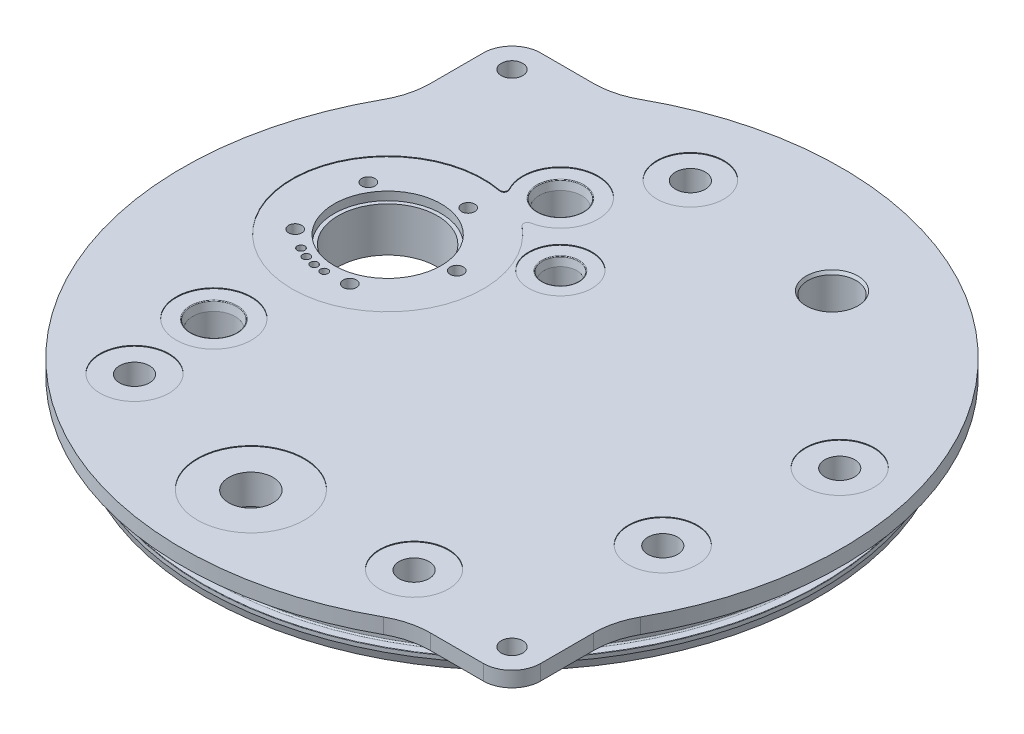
ISO-10303-21;
HEADER;
FILE_DESCRIPTION(('STEP AP214'),'2;1');
FILE_NAME('part.step','',(''),(''),'','','');
FILE_SCHEMA(('AUTOMOTIVE_DESIGN { 1 0 10303 214 1 1 1 1 }'));
ENDSEC;
DATA;
#1=APPLICATION_CONTEXT('core data for automotive mechanical design processes');
#2=APPLICATION_PROTOCOL_DEFINITION('international standard','automotive_design',2000,#1);
#3=PRODUCT_CONTEXT('',#1,'mechanical');
#4=PRODUCT('Part','Part','',(#3));
#5=PRODUCT_RELATED_PRODUCT_CATEGORY('part','',(#4));
#6=PRODUCT_DEFINITION_FORMATION('','',#4);
#7=PRODUCT_DEFINITION_CONTEXT('part definition',#1,'design');
#8=PRODUCT_DEFINITION('design','',#6,#7);
#9=PRODUCT_DEFINITION_SHAPE('','',#8);
#10=(LENGTH_UNIT() NAMED_UNIT(*) SI_UNIT(.MILLI.,.METRE.));
#11=(NAMED_UNIT(*) PLANE_ANGLE_UNIT() SI_UNIT($,.RADIAN.));
#12=(NAMED_UNIT(*) SI_UNIT($,.STERADIAN.) SOLID_ANGLE_UNIT());
#13=UNCERTAINTY_MEASURE_WITH_UNIT(LENGTH_MEASURE(1.E-05),#10,'distance_accuracy_value','');
#14=(GEOMETRIC_REPRESENTATION_CONTEXT(3) GLOBAL_UNCERTAINTY_ASSIGNED_CONTEXT((#13)) GLOBAL_UNIT_ASSIGNED_CONTEXT((#10,
#11,#12)) REPRESENTATION_CONTEXT('',''));
#15=CARTESIAN_POINT('',(0.,0.,0.));
#16=DIRECTION('',(0.,0.,1.));
#17=DIRECTION('',(1.,0.,0.));
#18=AXIS2_PLACEMENT_3D('',#15,#16,#17);
#19=CARTESIAN_POINT('',(0.,5.08,0.));
#20=DIRECTION('',(0.,-1.,0.));
#21=DIRECTION('',(0.,0.,-1.));
#22=AXIS2_PLACEMENT_3D('',#19,#20,#21);
#23=PLANE('',#22);
#24=CARTESIAN_POINT('',(78.7650354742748,5.08,28.6681284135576));
#25=DIRECTION('',(0.,1.,0.));
#26=DIRECTION('',(0.,0.,1.));
#27=AXIS2_PLACEMENT_3D('',#24,#25,#26);
#28=CIRCLE('',#27,11.43);
#29=CARTESIAN_POINT('',(78.7650354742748,5.08,40.0981284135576));
#30=VERTEX_POINT('',#29);
#31=EDGE_CURVE('E514',#30,#30,#28,.T.);
#32=ORIENTED_EDGE('',*,*,#31,.F.);
#33=EDGE_LOOP('',(#32));
#34=FACE_BOUND('',#33,.T.);
#35=CARTESIAN_POINT('',(-83.0673691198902,5.08,-83.0673691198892));
#36=DIRECTION('',(0.,1.,0.));
#37=DIRECTION('',(0.,0.,1.));
#38=AXIS2_PLACEMENT_3D('',#35,#36,#37);
#39=CIRCLE('',#38,3.571875);
#40=CARTESIAN_POINT('',(-83.0673691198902,5.08,-79.4954941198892));
#41=VERTEX_POINT('',#40);
#42=EDGE_CURVE('E358',#41,#41,#39,.T.);
#43=ORIENTED_EDGE('',*,*,#42,.F.);
#44=EDGE_LOOP('',(#43));
#45=FACE_BOUND('',#44,.T.);
#46=CARTESIAN_POINT('',(83.0673691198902,5.08,83.0673691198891));
#47=DIRECTION('',(0.,1.,0.));
#48=DIRECTION('',(0.,0.,1.));
#49=AXIS2_PLACEMENT_3D('',#46,#47,#48);
#50=CIRCLE('',#49,3.571875);
#51=CARTESIAN_POINT('',(83.0673691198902,5.08,86.6392441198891));
#52=VERTEX_POINT('',#51);
#53=EDGE_CURVE('E362',#52,#52,#50,.T.);
#54=ORIENTED_EDGE('',*,*,#53,.F.);
#55=EDGE_LOOP('',(#54));
#56=FACE_BOUND('',#55,.T.);
#57=CARTESIAN_POINT('',(0.,5.08,0.));
#58=DIRECTION('',(0.,1.,0.));
#59=DIRECTION('',(0.,0.,1.));
#60=AXIS2_PLACEMENT_3D('',#57,#58,#59);
#61=CIRCLE('',#60,109.5375);
#62=CARTESIAN_POINT('',(-95.7820408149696,5.08,-53.1438102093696));
#63=VERTEX_POINT('',#62);
#64=CARTESIAN_POINT('',(53.1438102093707,5.08,95.7820408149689));
#65=VERTEX_POINT('',#64);
#66=EDGE_CURVE('E446',#63,#65,#61,.T.);
#67=ORIENTED_EDGE('',*,*,#66,.T.);
#68=CARTESIAN_POINT('',(65.4670125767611,5.08,117.992369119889));
#69=DIRECTION('',(0.,-1.,0.));
#70=DIRECTION('',(0.,0.,1.));
#71=AXIS2_PLACEMENT_3D('',#68,#69,#70);
#72=CIRCLE('',#71,25.3999999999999);
#73=CARTESIAN_POINT('',(65.4670125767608,5.08,92.5923691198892));
#74=VERTEX_POINT('',#73);
#75=EDGE_CURVE('E382',#65,#74,#72,.T.);
#76=ORIENTED_EDGE('',*,*,#75,.T.);
#77=DIRECTION('',(1.,0.,0.));
#78=VECTOR('',#77,1.);
#79=CARTESIAN_POINT('',(83.0673691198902,5.08,92.5923691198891));
#80=LINE('',#79,#78);
#81=CARTESIAN_POINT('',(83.0673691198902,5.08,92.5923691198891));
#82=VERTEX_POINT('',#81);
#83=EDGE_CURVE('E385',#74,#82,#80,.T.);
#84=ORIENTED_EDGE('',*,*,#83,.T.);
#85=CARTESIAN_POINT('',(83.0673691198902,5.08,83.0673691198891));
#86=DIRECTION('',(0.,1.,0.));
#87=DIRECTION('',(0.,0.,-1.));
#88=AXIS2_PLACEMENT_3D('',#85,#86,#87);
#89=CIRCLE('',#88,9.52500000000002);
#90=CARTESIAN_POINT('',(92.5923691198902,5.08,83.0673691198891));
#91=VERTEX_POINT('',#90);
#92=EDGE_CURVE('E388',#82,#91,#89,.T.);
#93=ORIENTED_EDGE('',*,*,#92,.T.);
#94=DIRECTION('',(0.,0.,-1.));
#95=VECTOR('',#94,1.);
#96=CARTESIAN_POINT('',(92.5923691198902,5.08,83.0673691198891));
#97=LINE('',#96,#95);
#98=CARTESIAN_POINT('',(92.5923691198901,5.08,65.4670125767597));
#99=VERTEX_POINT('',#98);
#100=EDGE_CURVE('E391',#91,#99,#97,.T.);
#101=ORIENTED_EDGE('',*,*,#100,.T.);
#102=CARTESIAN_POINT('',(117.99236911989,5.08,65.4670125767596));
#103=DIRECTION('',(0.,-1.,0.));
#104=DIRECTION('',(0.,0.,-1.));
#105=AXIS2_PLACEMENT_3D('',#102,#103,#104);
#106=CIRCLE('',#105,25.4);
#107=CARTESIAN_POINT('',(95.7820408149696,5.08,53.1438102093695));
#108=VERTEX_POINT('',#107);
#109=EDGE_CURVE('E368',#99,#108,#106,.T.);
#110=ORIENTED_EDGE('',*,*,#109,.T.);
#111=CARTESIAN_POINT('',(-53.1438102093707,5.08,-95.782040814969));
#112=VERTEX_POINT('',#111);
#113=EDGE_CURVE('E445',#108,#112,#61,.T.);
#114=ORIENTED_EDGE('',*,*,#113,.T.);
#115=CARTESIAN_POINT('',(-65.4670125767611,5.08,-117.992369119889));
#116=DIRECTION('',(0.,-1.,0.));
#117=DIRECTION('',(0.,0.,1.));
#118=AXIS2_PLACEMENT_3D('',#115,#116,#117);
#119=CIRCLE('',#118,25.4);
#120=CARTESIAN_POINT('',(-65.4670125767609,5.08,-92.5923691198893));
#121=VERTEX_POINT('',#120);
#122=EDGE_CURVE('E425',#112,#121,#119,.T.);
#123=ORIENTED_EDGE('',*,*,#122,.T.);
#124=DIRECTION('',(-1.,0.,0.));
#125=VECTOR('',#124,1.);
#126=CARTESIAN_POINT('',(-83.0673691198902,5.08,-92.5923691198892));
#127=LINE('',#126,#125);
#128=CARTESIAN_POINT('',(-83.0673691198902,5.08,-92.5923691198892));
#129=VERTEX_POINT('',#128);
#130=EDGE_CURVE('E428',#121,#129,#127,.T.);
#131=ORIENTED_EDGE('',*,*,#130,.T.);
#132=CARTESIAN_POINT('',(-83.0673691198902,5.08,-83.0673691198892));
#133=DIRECTION('',(0.,1.,0.));
#134=DIRECTION('',(0.,0.,1.));
#135=AXIS2_PLACEMENT_3D('',#132,#133,#134);
#136=CIRCLE('',#135,9.52500000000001);
#137=CARTESIAN_POINT('',(-92.5923691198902,5.08,-83.0673691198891));
#138=VERTEX_POINT('',#137);
#139=EDGE_CURVE('E380',#129,#138,#136,.T.);
#140=ORIENTED_EDGE('',*,*,#139,.T.);
#141=DIRECTION('',(0.,0.,1.));
#142=VECTOR('',#141,1.);
#143=CARTESIAN_POINT('',(-92.5923691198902,5.08,-83.0673691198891));
#144=LINE('',#143,#142);
#145=CARTESIAN_POINT('',(-92.5923691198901,5.08,-65.4670125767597));
#146=VERTEX_POINT('',#145);
#147=EDGE_CURVE('E420',#138,#146,#144,.T.);
#148=ORIENTED_EDGE('',*,*,#147,.T.);
#149=CARTESIAN_POINT('',(-117.99236911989,5.08,-65.4670125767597));
#150=DIRECTION('',(0.,-1.,0.));
#151=DIRECTION('',(0.,0.,-1.));
#152=AXIS2_PLACEMENT_3D('',#149,#150,#151);
#153=CIRCLE('',#152,25.4);
#154=EDGE_CURVE('E423',#146,#63,#153,.T.);
#155=ORIENTED_EDGE('',*,*,#154,.T.);
#156=EDGE_LOOP('',(#67,#76,#84,#93,#101,#110,#114,#123,#131,#140,#148,#155));
#157=FACE_BOUND('',#156,.T.);
#158=CARTESIAN_POINT('',(-56.4293867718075,5.08,-15.1202086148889));
#159=DIRECTION('',(0.,1.,0.));
#160=DIRECTION('',(0.,0.,1.));
#161=AXIS2_PLACEMENT_3D('',#158,#159,#160);
#162=CIRCLE('',#161,31.75);
#163=CARTESIAN_POINT('',(-50.4468571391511,5.08,-46.3014824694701));
#164=VERTEX_POINT('',#163);
#165=CARTESIAN_POINT('',(-36.3886411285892,5.08,-39.7460286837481));
#166=VERTEX_POINT('',#165);
#167=EDGE_CURVE('E319',#164,#166,#162,.T.);
#168=ORIENTED_EDGE('',*,*,#167,.F.);
#169=CARTESIAN_POINT('',(-50.2075559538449,5.08,-47.5487334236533));
#170=DIRECTION('',(0.,-1.,0.));
#171=DIRECTION('',(0.,0.,-1.));
#172=AXIS2_PLACEMENT_3D('',#169,#170,#171);
#173=CIRCLE('',#172,1.27);
#174=CARTESIAN_POINT('',(-49.0983280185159,5.08,-48.167210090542));
#175=VERTEX_POINT('',#174);
#176=EDGE_CURVE('E489',#164,#175,#173,.F.);
#177=ORIENTED_EDGE('',*,*,#176,.T.);
#178=CARTESIAN_POINT('',(-38.1807302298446,5.08,-54.2545788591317));
#179=DIRECTION('',(0.,1.,0.));
#180=DIRECTION('',(0.,0.,1.));
#181=AXIS2_PLACEMENT_3D('',#178,#179,#180);
#182=CIRCLE('',#181,12.5);
#183=CARTESIAN_POINT('',(-35.8262286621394,5.08,-41.9783285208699));
#184=VERTEX_POINT('',#183);
#185=EDGE_CURVE('E270',#184,#175,#182,.T.);
#186=ORIENTED_EDGE('',*,*,#185,.F.);
#187=CARTESIAN_POINT('',(-35.5870113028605,5.08,-40.7310614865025));
#188=DIRECTION('',(0.,-1.,0.));
#189=DIRECTION('',(0.,0.,-1.));
#190=AXIS2_PLACEMENT_3D('',#187,#188,#189);
#191=CIRCLE('',#190,1.27);
#192=EDGE_CURVE('E487',#184,#166,#191,.F.);
#193=ORIENTED_EDGE('',*,*,#192,.T.);
#194=EDGE_LOOP('',(#168,#177,#186,#193));
#195=FACE_BOUND('',#194,.T.);
#196=CARTESIAN_POINT('',(-17.2950165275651,5.08,-33.3688651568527));
#197=DIRECTION('',(0.,1.,0.));
#198=DIRECTION('',(0.,0.,1.));
#199=AXIS2_PLACEMENT_3D('',#196,#197,#198);
#200=CIRCLE('',#199,10.5);
#201=CARTESIAN_POINT('',(-17.2950165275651,5.08,-22.8688651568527));
#202=VERTEX_POINT('',#201);
#203=EDGE_CURVE('E246',#202,#202,#200,.T.);
#204=ORIENTED_EDGE('',*,*,#203,.F.);
#205=EDGE_LOOP('',(#204));
#206=FACE_BOUND('',#205,.T.);
#207=CARTESIAN_POINT('',(-60.96,5.07999999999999,38.1));
#208=DIRECTION('',(0.,1.,0.));
#209=DIRECTION('',(0.,0.,1.));
#210=AXIS2_PLACEMENT_3D('',#207,#208,#209);
#211=CIRCLE('',#210,12.5);
#212=CARTESIAN_POINT('',(-60.96,5.07999999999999,50.6));
#213=VERTEX_POINT('',#212);
#214=EDGE_CURVE('E221',#213,#213,#211,.T.);
#215=ORIENTED_EDGE('',*,*,#214,.F.);
#216=EDGE_LOOP('',(#215));
#217=FACE_BOUND('',#216,.T.);
#218=CARTESIAN_POINT('',(33.8136871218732,5.07999999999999,-72.5136860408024));
#219=DIRECTION('',(0.,-1.,0.));
#220=DIRECTION('',(0.,0.,-1.));
#221=AXIS2_PLACEMENT_3D('',#218,#219,#220);
#222=CIRCLE('',#221,8.606588);
#223=CARTESIAN_POINT('',(33.8136871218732,5.07999999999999,-81.1202740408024));
#224=VERTEX_POINT('',#223);
#225=EDGE_CURVE('E182',#224,#224,#222,.T.);
#226=ORIENTED_EDGE('',*,*,#225,.T.);
#227=EDGE_LOOP('',(#226));
#228=FACE_BOUND('',#227,.T.);
#229=CARTESIAN_POINT('',(-5.6698061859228,5.08,81.0820060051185));
#230=DIRECTION('',(0.,1.,0.));
#231=DIRECTION('',(0.,0.,1.));
#232=AXIS2_PLACEMENT_3D('',#229,#230,#231);
#233=CIRCLE('',#232,17.78);
#234=CARTESIAN_POINT('',(-5.6698061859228,5.08,98.8620060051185));
#235=VERTEX_POINT('',#234);
#236=EDGE_CURVE('E499',#235,#235,#233,.T.);
#237=ORIENTED_EDGE('',*,*,#236,.F.);
#238=EDGE_LOOP('',(#237));
#239=FACE_BOUND('',#238,.T.);
#240=CARTESIAN_POINT('',(44.4500000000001,5.08,76.9896583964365));
#241=DIRECTION('',(0.,1.,0.));
#242=DIRECTION('',(0.,0.,1.));
#243=AXIS2_PLACEMENT_3D('',#240,#241,#242);
#244=CIRCLE('',#243,11.43);
#245=CARTESIAN_POINT('',(44.4500000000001,5.08,88.4196583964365));
#246=VERTEX_POINT('',#245);
#247=EDGE_CURVE('E520',#246,#246,#244,.T.);
#248=ORIENTED_EDGE('',*,*,#247,.F.);
#249=EDGE_LOOP('',(#248));
#250=FACE_BOUND('',#249,.T.);
#251=CARTESIAN_POINT('',(-58.3236476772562,5.08,67.0936816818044));
#252=DIRECTION('',(0.,1.,0.));
#253=DIRECTION('',(0.,0.,1.));
#254=AXIS2_PLACEMENT_3D('',#251,#252,#253);
#255=CIRCLE('',#254,11.43);
#256=CARTESIAN_POINT('',(-58.3236476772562,5.08,78.5236816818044));
#257=VERTEX_POINT('',#256);
#258=EDGE_CURVE('E526',#257,#257,#255,.T.);
#259=ORIENTED_EDGE('',*,*,#258,.F.);
#260=EDGE_LOOP('',(#259));
#261=FACE_BOUND('',#260,.T.);
#262=CARTESIAN_POINT('',(85.8708059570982,5.08,-23.0090131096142));
#263=DIRECTION('',(0.,1.,0.));
#264=DIRECTION('',(0.,0.,1.));
#265=AXIS2_PLACEMENT_3D('',#262,#263,#264);
#266=CIRCLE('',#265,11.43);
#267=CARTESIAN_POINT('',(85.8708059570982,5.08,-11.5790131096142));
#268=VERTEX_POINT('',#267);
#269=EDGE_CURVE('E532',#268,#268,#266,.T.);
#270=ORIENTED_EDGE('',*,*,#269,.F.);
#271=EDGE_LOOP('',(#270));
#272=FACE_BOUND('',#271,.T.);
#273=CARTESIAN_POINT('',(-21.6942123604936,5.08,-80.9639027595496));
#274=DIRECTION('',(0.,1.,0.));
#275=DIRECTION('',(0.,0.,1.));
#276=AXIS2_PLACEMENT_3D('',#273,#274,#275);
#277=CIRCLE('',#276,11.1252);
#278=CARTESIAN_POINT('',(-21.6942123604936,5.08,-69.8387027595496));
#279=VERTEX_POINT('',#278);
#280=EDGE_CURVE('E568',#279,#279,#277,.T.);
#281=ORIENTED_EDGE('',*,*,#280,.F.);
#282=EDGE_LOOP('',(#281));
#283=FACE_BOUND('',#282,.T.);
#284=ADVANCED_FACE('F41',(#34,#45,#56,#157,#195,#206,#217,#228,#239,#250,#261,#272,#283),#23,.F.);
#285=CARTESIAN_POINT('',(-101.897309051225,-12.7,0.));
#286=DIRECTION('',(0.,1.,0.));
#287=DIRECTION('',(0.,0.,1.));
#288=AXIS2_PLACEMENT_3D('',#285,#286,#287);
#289=PLANE('',#288);
#290=CARTESIAN_POINT('',(-21.6942123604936,-12.7,-80.9639027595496));
#291=DIRECTION('',(0.,1.,0.));
#292=DIRECTION('',(0.,0.,1.));
#293=AXIS2_PLACEMENT_3D('',#290,#291,#292);
#294=CIRCLE('',#293,4.96062);
#295=CARTESIAN_POINT('',(-21.6942123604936,-12.7,-76.0032827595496));
#296=VERTEX_POINT('',#295);
#297=EDGE_CURVE('E559',#296,#296,#294,.T.);
#298=ORIENTED_EDGE('',*,*,#297,.T.);
#299=EDGE_LOOP('',(#298));
#300=FACE_BOUND('',#299,.T.);
#301=CARTESIAN_POINT('',(-58.3236476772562,-12.7,67.0936816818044));
#302=DIRECTION('',(0.,1.,0.));
#303=DIRECTION('',(0.,0.,1.));
#304=AXIS2_PLACEMENT_3D('',#301,#302,#303);
#305=CIRCLE('',#304,4.96061999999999);
#306=CARTESIAN_POINT('',(-58.3236476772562,-12.7,72.0543016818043));
#307=VERTEX_POINT('',#306);
#308=EDGE_CURVE('E556',#307,#307,#305,.T.);
#309=ORIENTED_EDGE('',*,*,#308,.T.);
#310=EDGE_LOOP('',(#309));
#311=FACE_BOUND('',#310,.T.);
#312=CARTESIAN_POINT('',(44.4500000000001,-12.7,76.9896583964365));
#313=DIRECTION('',(0.,1.,0.));
#314=DIRECTION('',(0.,0.,1.));
#315=AXIS2_PLACEMENT_3D('',#312,#313,#314);
#316=CIRCLE('',#315,4.96061999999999);
#317=CARTESIAN_POINT('',(44.4500000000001,-12.7,81.9502783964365));
#318=VERTEX_POINT('',#317);
#319=EDGE_CURVE('E550',#318,#318,#316,.T.);
#320=ORIENTED_EDGE('',*,*,#319,.T.);
#321=EDGE_LOOP('',(#320));
#322=FACE_BOUND('',#321,.T.);
#323=CARTESIAN_POINT('',(78.7650354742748,-12.7,28.6681284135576));
#324=DIRECTION('',(0.,1.,0.));
#325=DIRECTION('',(0.,0.,1.));
#326=AXIS2_PLACEMENT_3D('',#323,#324,#325);
#327=CIRCLE('',#326,4.96062);
#328=CARTESIAN_POINT('',(78.7650354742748,-12.7,33.6287484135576));
#329=VERTEX_POINT('',#328);
#330=EDGE_CURVE('E544',#329,#329,#327,.T.);
#331=ORIENTED_EDGE('',*,*,#330,.T.);
#332=EDGE_LOOP('',(#331));
#333=FACE_BOUND('',#332,.T.);
#334=CARTESIAN_POINT('',(85.8708059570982,-12.7,-23.0090131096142));
#335=DIRECTION('',(0.,1.,0.));
#336=DIRECTION('',(0.,0.,1.));
#337=AXIS2_PLACEMENT_3D('',#334,#335,#336);
#338=CIRCLE('',#337,4.96062);
#339=CARTESIAN_POINT('',(85.8708059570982,-12.7,-18.0483931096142));
#340=VERTEX_POINT('',#339);
#341=EDGE_CURVE('E538',#340,#340,#338,.T.);
#342=ORIENTED_EDGE('',*,*,#341,.T.);
#343=EDGE_LOOP('',(#342));
#344=FACE_BOUND('',#343,.T.);
#345=CARTESIAN_POINT('',(33.8136871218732,-12.7,-72.5136860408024));
#346=DIRECTION('',(0.,-1.,0.));
#347=DIRECTION('',(0.,0.,-1.));
#348=AXIS2_PLACEMENT_3D('',#345,#346,#347);
#349=CIRCLE('',#348,15.875);
#350=CARTESIAN_POINT('',(33.8136871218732,-12.7,-88.3886860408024));
#351=VERTEX_POINT('',#350);
#352=EDGE_CURVE('E185',#351,#351,#349,.T.);
#353=ORIENTED_EDGE('',*,*,#352,.F.);
#354=EDGE_LOOP('',(#353));
#355=FACE_BOUND('',#354,.T.);
#356=CARTESIAN_POINT('',(0.,-12.7,0.));
#357=DIRECTION('',(0.,-1.,0.));
#358=DIRECTION('',(0.,0.,-1.));
#359=AXIS2_PLACEMENT_3D('',#356,#357,#358);
#360=CIRCLE('',#359,101.897309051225);
#361=CARTESIAN_POINT('',(0.,-12.7,-101.897309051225));
#362=VERTEX_POINT('',#361);
#363=EDGE_CURVE('E454',#362,#362,#360,.T.);
#364=ORIENTED_EDGE('',*,*,#363,.T.);
#365=EDGE_LOOP('',(#364));
#366=FACE_BOUND('',#365,.T.);
#367=CARTESIAN_POINT('',(-56.4293867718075,-12.7,-15.1202086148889));
#368=DIRECTION('',(0.,1.,0.));
#369=DIRECTION('',(0.,0.,1.));
#370=AXIS2_PLACEMENT_3D('',#367,#368,#369);
#371=CIRCLE('',#370,16.51);
#372=CARTESIAN_POINT('',(-56.4293867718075,-12.7,1.38979138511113));
#373=VERTEX_POINT('',#372);
#374=EDGE_CURVE('E331',#373,#373,#371,.T.);
#375=ORIENTED_EDGE('',*,*,#374,.T.);
#376=EDGE_LOOP('',(#375));
#377=FACE_BOUND('',#376,.T.);
#378=CARTESIAN_POINT('',(-56.4293867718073,-12.7,5.96179138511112));
#379=DIRECTION('',(0.,1.,0.));
#380=DIRECTION('',(0.,0.,1.));
#381=AXIS2_PLACEMENT_3D('',#378,#379,#380);
#382=CIRCLE('',#381,1.26999999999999);
#383=CARTESIAN_POINT('',(-56.4293867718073,-12.7,7.23179138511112));
#384=VERTEX_POINT('',#383);
#385=EDGE_CURVE('E313',#384,#384,#382,.T.);
#386=ORIENTED_EDGE('',*,*,#385,.T.);
#387=EDGE_LOOP('',(#386));
#388=FACE_BOUND('',#387,.T.);
#389=CARTESIAN_POINT('',(-60.0902376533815,-12.7,5.64150843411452));
#390=DIRECTION('',(0.,1.,0.));
#391=DIRECTION('',(0.,0.,1.));
#392=AXIS2_PLACEMENT_3D('',#389,#390,#391);
#393=CIRCLE('',#392,1.26999999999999);
#394=CARTESIAN_POINT('',(-60.0902376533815,-12.7,6.91150843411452));
#395=VERTEX_POINT('',#394);
#396=EDGE_CURVE('E307',#395,#395,#393,.T.);
#397=ORIENTED_EDGE('',*,*,#396,.T.);
#398=EDGE_LOOP('',(#397));
#399=FACE_BOUND('',#398,.T.);
#400=CARTESIAN_POINT('',(-63.6398554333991,-12.7,4.69039121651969));
#401=DIRECTION('',(0.,1.,0.));
#402=DIRECTION('',(0.,0.,1.));
#403=AXIS2_PLACEMENT_3D('',#400,#401,#402);
#404=CIRCLE('',#403,1.26999999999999);
#405=CARTESIAN_POINT('',(-63.6398554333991,-12.7,5.96039121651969));
#406=VERTEX_POINT('',#405);
#407=EDGE_CURVE('E301',#406,#406,#404,.T.);
#408=ORIENTED_EDGE('',*,*,#407,.T.);
#409=EDGE_LOOP('',(#408));
#410=FACE_BOUND('',#409,.T.);
#411=CARTESIAN_POINT('',(-66.9703867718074,-12.7,3.13733894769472));
#412=DIRECTION('',(0.,1.,0.));
#413=DIRECTION('',(0.,0.,1.));
#414=AXIS2_PLACEMENT_3D('',#411,#412,#413);
#415=CIRCLE('',#414,1.26999999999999);
#416=CARTESIAN_POINT('',(-66.9703867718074,-12.7,4.40733894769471));
#417=VERTEX_POINT('',#416);
#418=EDGE_CURVE('E297',#417,#417,#415,.T.);
#419=ORIENTED_EDGE('',*,*,#418,.T.);
#420=EDGE_LOOP('',(#419));
#421=FACE_BOUND('',#420,.T.);
#422=CARTESIAN_POINT('',(-34.6153232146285,-12.7,-16.2634352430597));
#423=DIRECTION('',(0.,1.,0.));
#424=DIRECTION('',(0.,0.,1.));
#425=AXIS2_PLACEMENT_3D('',#422,#423,#424);
#426=CIRCLE('',#425,2.19709999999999);
#427=CARTESIAN_POINT('',(-34.6153232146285,-12.7,-14.0663352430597));
#428=VERTEX_POINT('',#427);
#429=EDGE_CURVE('E293',#428,#428,#426,.T.);
#430=ORIENTED_EDGE('',*,*,#429,.T.);
#431=EDGE_LOOP('',(#430));
#432=FACE_BOUND('',#431,.T.);
#433=CARTESIAN_POINT('',(-48.60119728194,-12.7,5.27292222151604));
#434=DIRECTION('',(0.,1.,0.));
#435=DIRECTION('',(0.,0.,1.));
#436=AXIS2_PLACEMENT_3D('',#433,#434,#435);
#437=CIRCLE('',#436,2.19709999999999);
#438=CARTESIAN_POINT('',(-48.60119728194,-12.7,7.47002222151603));
#439=VERTEX_POINT('',#438);
#440=EDGE_CURVE('E287',#439,#439,#437,.T.);
#441=ORIENTED_EDGE('',*,*,#440,.T.);
#442=EDGE_LOOP('',(#441));
#443=FACE_BOUND('',#442,.T.);
#444=CARTESIAN_POINT('',(-73.4053631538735,-12.7,-1.37333399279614));
#445=DIRECTION('',(0.,1.,0.));
#446=DIRECTION('',(0.,0.,1.));
#447=AXIS2_PLACEMENT_3D('',#444,#445,#446);
#448=CIRCLE('',#447,2.19709999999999);
#449=CARTESIAN_POINT('',(-73.4053631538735,-12.7,0.823766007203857));
#450=VERTEX_POINT('',#449);
#451=EDGE_CURVE('E283',#450,#450,#448,.T.);
#452=ORIENTED_EDGE('',*,*,#451,.T.);
#453=EDGE_LOOP('',(#452));
#454=FACE_BOUND('',#453,.T.);
#455=CARTESIAN_POINT('',(-74.7493066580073,-12.7,-27.0173036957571));
#456=DIRECTION('',(0.,1.,0.));
#457=DIRECTION('',(0.,0.,1.));
#458=AXIS2_PLACEMENT_3D('',#455,#456,#457);
#459=CIRCLE('',#458,2.19709999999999);
#460=CARTESIAN_POINT('',(-74.7493066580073,-12.7,-24.8202036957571));
#461=VERTEX_POINT('',#460);
#462=EDGE_CURVE('E279',#461,#461,#459,.T.);
#463=ORIENTED_EDGE('',*,*,#462,.T.);
#464=EDGE_LOOP('',(#463));
#465=FACE_BOUND('',#464,.T.);
#466=CARTESIAN_POINT('',(-50.775743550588,-12.7,-36.2198923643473));
#467=DIRECTION('',(0.,1.,0.));
#468=DIRECTION('',(0.,0.,1.));
#469=AXIS2_PLACEMENT_3D('',#466,#467,#468);
#470=CIRCLE('',#469,2.19709999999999);
#471=CARTESIAN_POINT('',(-50.775743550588,-12.7,-34.0227923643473));
#472=VERTEX_POINT('',#471);
#473=EDGE_CURVE('E273',#472,#472,#470,.T.);
#474=ORIENTED_EDGE('',*,*,#473,.T.);
#475=EDGE_LOOP('',(#474));
#476=FACE_BOUND('',#475,.T.);
#477=CARTESIAN_POINT('',(-38.1807302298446,-12.7,-54.2545788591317));
#478=DIRECTION('',(0.,1.,0.));
#479=DIRECTION('',(0.,0.,1.));
#480=AXIS2_PLACEMENT_3D('',#477,#478,#479);
#481=CIRCLE('',#480,6.54811999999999);
#482=CARTESIAN_POINT('',(-38.1807302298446,-12.7,-47.7064588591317));
#483=VERTEX_POINT('',#482);
#484=EDGE_CURVE('E272',#483,#483,#481,.T.);
#485=ORIENTED_EDGE('',*,*,#484,.T.);
#486=EDGE_LOOP('',(#485));
#487=FACE_BOUND('',#486,.T.);
#488=CARTESIAN_POINT('',(-17.2950165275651,-12.7,-33.3688651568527));
#489=DIRECTION('',(0.,1.,0.));
#490=DIRECTION('',(0.,0.,1.));
#491=AXIS2_PLACEMENT_3D('',#488,#489,#490);
#492=CIRCLE('',#491,4.96062);
#493=CARTESIAN_POINT('',(-17.2950165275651,-12.7,-28.4082451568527));
#494=VERTEX_POINT('',#493);
#495=EDGE_CURVE('E249',#494,#494,#492,.T.);
#496=ORIENTED_EDGE('',*,*,#495,.T.);
#497=EDGE_LOOP('',(#496));
#498=FACE_BOUND('',#497,.T.);
#499=CARTESIAN_POINT('',(-60.96,-12.7,38.1));
#500=DIRECTION('',(0.,1.,0.));
#501=DIRECTION('',(0.,0.,1.));
#502=AXIS2_PLACEMENT_3D('',#499,#500,#501);
#503=CIRCLE('',#502,3.17628976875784);
#504=CARTESIAN_POINT('',(-60.96,-12.7,41.2762897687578));
#505=VERTEX_POINT('',#504);
#506=EDGE_CURVE('E224',#505,#505,#503,.T.);
#507=ORIENTED_EDGE('',*,*,#506,.T.);
#508=EDGE_LOOP('',(#507));
#509=FACE_BOUND('',#508,.T.);
#510=CARTESIAN_POINT('',(59.2136871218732,-12.7,-72.5136860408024));
#511=DIRECTION('',(0.,-1.,0.));
#512=DIRECTION('',(0.,0.,-1.));
#513=AXIS2_PLACEMENT_3D('',#510,#511,#512);
#514=CIRCLE('',#513,1.13029999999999);
#515=CARTESIAN_POINT('',(59.2136871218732,-12.7,-73.6439860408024));
#516=VERTEX_POINT('',#515);
#517=EDGE_CURVE('E169',#516,#516,#514,.T.);
#518=ORIENTED_EDGE('',*,*,#517,.F.);
#519=EDGE_LOOP('',(#518));
#520=FACE_BOUND('',#519,.T.);
#521=CARTESIAN_POINT('',(8.41368712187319,-12.7,-72.5136860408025));
#522=DIRECTION('',(0.,-1.,0.));
#523=DIRECTION('',(0.,0.,-1.));
#524=AXIS2_PLACEMENT_3D('',#521,#522,#523);
#525=CIRCLE('',#524,1.13029999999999);
#526=CARTESIAN_POINT('',(8.41368712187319,-12.7,-73.6439860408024));
#527=VERTEX_POINT('',#526);
#528=EDGE_CURVE('E170',#527,#527,#525,.T.);
#529=ORIENTED_EDGE('',*,*,#528,.F.);
#530=EDGE_LOOP('',(#529));
#531=FACE_BOUND('',#530,.T.);
#532=CARTESIAN_POINT('',(-5.6698061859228,-12.7,81.0820060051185));
#533=DIRECTION('',(0.,-1.,0.));
#534=DIRECTION('',(0.,0.,-1.));
#535=AXIS2_PLACEMENT_3D('',#532,#533,#534);
#536=CIRCLE('',#535,14.2875);
#537=CARTESIAN_POINT('',(-5.6698061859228,-12.7,66.7945060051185));
#538=VERTEX_POINT('',#537);
#539=EDGE_CURVE('E508',#538,#538,#536,.T.);
#540=ORIENTED_EDGE('',*,*,#539,.F.);
#541=EDGE_LOOP('',(#540));
#542=FACE_BOUND('',#541,.T.);
#543=ADVANCED_FACE('F575',(#300,#311,#322,#333,#344,#355,#366,#377,#388,#399,#410,#421,#432,
#443,#454,#465,#476,#487,#498,#509,#520,#531,#542),#289,.F.);
#544=CARTESIAN_POINT('',(-56.4293867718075,5.08,-15.1202086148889));
#545=DIRECTION('',(0.,1.,0.));
#546=DIRECTION('',(0.,0.,1.));
#547=AXIS2_PLACEMENT_3D('',#544,#545,#546);
#548=CYLINDRICAL_SURFACE('',#547,17.78);
#549=CARTESIAN_POINT('',(-56.4293867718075,2.032,-15.1202086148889));
#550=DIRECTION('',(0.,1.,0.));
#551=DIRECTION('',(0.,0.,1.));
#552=AXIS2_PLACEMENT_3D('',#549,#550,#551);
#553=CIRCLE('',#552,17.78);
#554=CARTESIAN_POINT('',(-56.4293867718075,2.032,2.65979138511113));
#555=VERTEX_POINT('',#554);
#556=EDGE_CURVE('E325',#555,#555,#553,.T.);
#557=ORIENTED_EDGE('',*,*,#556,.F.);
#558=EDGE_LOOP('',(#557));
#559=FACE_BOUND('',#558,.T.);
#560=CARTESIAN_POINT('',(-56.4293867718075,4.826,-15.1202086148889));
#561=DIRECTION('',(0.,1.,0.));
#562=DIRECTION('',(0.,0.,1.));
#563=AXIS2_PLACEMENT_3D('',#560,#561,#562);
#564=CIRCLE('',#563,17.78);
#565=CARTESIAN_POINT('',(-56.4293867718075,4.826,2.65979138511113));
#566=VERTEX_POINT('',#565);
#567=EDGE_CURVE('E322',#566,#566,#564,.F.);
#568=ORIENTED_EDGE('',*,*,#567,.F.);
#569=EDGE_LOOP('',(#568));
#570=FACE_BOUND('',#569,.T.);
#571=ADVANCED_FACE('F581',(#559,#570),#548,.F.);
#572=CARTESIAN_POINT('',(0.,-18.420388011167,0.));
#573=DIRECTION('',(0.,-1.,0.));
#574=DIRECTION('',(0.,0.,-1.));
#575=AXIS2_PLACEMENT_3D('',#572,#573,#574);
#576=CYLINDRICAL_SURFACE('',#575,102.5779);
#577=CARTESIAN_POINT('',(0.,0.,0.));
#578=DIRECTION('',(0.,-1.,0.));
#579=DIRECTION('',(0.,0.,-1.));
#580=AXIS2_PLACEMENT_3D('',#577,#578,#579);
#581=CIRCLE('',#580,102.5779);
#582=CARTESIAN_POINT('',(0.,0.,-102.5779));
#583=VERTEX_POINT('',#582);
#584=EDGE_CURVE('E460',#583,#583,#581,.T.);
#585=ORIENTED_EDGE('',*,*,#584,.T.);
#586=EDGE_LOOP('',(#585));
#587=FACE_BOUND('',#586,.T.);
#588=CARTESIAN_POINT('',(0.,-3.81635000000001,0.));
#589=DIRECTION('',(0.,1.,0.));
#590=DIRECTION('',(0.,0.,1.));
#591=AXIS2_PLACEMENT_3D('',#588,#589,#590);
#592=CIRCLE('',#591,102.5779);
#593=CARTESIAN_POINT('',(0.,-3.81635000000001,102.5779));
#594=VERTEX_POINT('',#593);
#595=EDGE_CURVE('E355',#594,#594,#592,.T.);
#596=ORIENTED_EDGE('',*,*,#595,.T.);
#597=EDGE_LOOP('',(#596));
#598=FACE_BOUND('',#597,.T.);
#599=ADVANCED_FACE('F848',(#587,#598),#576,.T.);
#600=CARTESIAN_POINT('',(0.,-12.7,0.));
#601=DIRECTION('',(0.,1.,0.));
#602=DIRECTION('',(0.,0.,1.));
#603=AXIS2_PLACEMENT_3D('',#600,#601,#602);
#604=CYLINDRICAL_SURFACE('',#603,109.5375);
#605=CARTESIAN_POINT('',(0.,0.,0.));
#606=DIRECTION('',(0.,1.,0.));
#607=DIRECTION('',(0.,0.,1.));
#608=AXIS2_PLACEMENT_3D('',#605,#606,#607);
#609=CIRCLE('',#608,109.5375);
#610=CARTESIAN_POINT('',(-95.7820408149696,0.,-53.1438102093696));
#611=VERTEX_POINT('',#610);
#612=CARTESIAN_POINT('',(53.1438102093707,0.,95.7820408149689));
#613=VERTEX_POINT('',#612);
#614=EDGE_CURVE('E450',#611,#613,#609,.T.);
#615=ORIENTED_EDGE('',*,*,#614,.T.);
#616=DIRECTION('',(0.,1.,0.));
#617=VECTOR('',#616,1.);
#618=CARTESIAN_POINT('',(53.1438102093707,-60.2995639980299,95.7820408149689));
#619=LINE('',#618,#617);
#620=EDGE_CURVE('E402',#613,#65,#619,.T.);
#621=ORIENTED_EDGE('',*,*,#620,.T.);
#622=ORIENTED_EDGE('',*,*,#66,.F.);
#623=DIRECTION('',(0.,1.,0.));
#624=VECTOR('',#623,1.);
#625=CARTESIAN_POINT('',(-95.7820408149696,-60.2995639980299,-53.1438102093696));
#626=LINE('',#625,#624);
#627=EDGE_CURVE('E438',#611,#63,#626,.T.);
#628=ORIENTED_EDGE('',*,*,#627,.F.);
#629=EDGE_LOOP('',(#615,#621,#622,#628));
#630=FACE_BOUND('',#629,.T.);
#631=ADVANCED_FACE('F937',(#630),#604,.T.);
#632=DIRECTION('',(0.,1.,0.));
#633=VECTOR('',#632,1.);
#634=CARTESIAN_POINT('',(95.7820408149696,-60.2995639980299,53.1438102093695));
#635=LINE('',#634,#633);
#636=CARTESIAN_POINT('',(95.7820408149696,0.,53.1438102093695));
#637=VERTEX_POINT('',#636);
#638=EDGE_CURVE('E394',#637,#108,#635,.T.);
#639=ORIENTED_EDGE('',*,*,#638,.F.);
#640=CARTESIAN_POINT('',(-53.1438102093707,0.,-95.782040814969));
#641=VERTEX_POINT('',#640);
#642=EDGE_CURVE('E449',#637,#641,#609,.T.);
#643=ORIENTED_EDGE('',*,*,#642,.T.);
#644=DIRECTION('',(0.,1.,0.));
#645=VECTOR('',#644,1.);
#646=CARTESIAN_POINT('',(-53.1438102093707,-60.2995639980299,-95.782040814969));
#647=LINE('',#646,#645);
#648=EDGE_CURVE('E435',#641,#112,#647,.T.);
#649=ORIENTED_EDGE('',*,*,#648,.T.);
#650=ORIENTED_EDGE('',*,*,#113,.F.);
#651=EDGE_LOOP('',(#639,#643,#649,#650));
#652=FACE_BOUND('',#651,.T.);
#653=ADVANCED_FACE('F935',(#652),#604,.T.);
#654=CARTESIAN_POINT('',(-121.221499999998,0.,0.));
#655=DIRECTION('',(0.,1.,0.));
#656=DIRECTION('',(0.,0.,1.));
#657=AXIS2_PLACEMENT_3D('',#654,#655,#656);
#658=PLANE('',#657);
#659=CARTESIAN_POINT('',(-83.0673691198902,0.,-83.0673691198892));
#660=DIRECTION('',(0.,1.,0.));
#661=DIRECTION('',(0.,0.,1.));
#662=AXIS2_PLACEMENT_3D('',#659,#660,#661);
#663=CIRCLE('',#662,3.571875);
#664=CARTESIAN_POINT('',(-83.0673691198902,0.,-79.4954941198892));
#665=VERTEX_POINT('',#664);
#666=EDGE_CURVE('E361',#665,#665,#663,.T.);
#667=ORIENTED_EDGE('',*,*,#666,.T.);
#668=EDGE_LOOP('',(#667));
#669=FACE_BOUND('',#668,.T.);
#670=CARTESIAN_POINT('',(83.0673691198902,0.,83.0673691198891));
#671=DIRECTION('',(0.,1.,0.));
#672=DIRECTION('',(0.,0.,1.));
#673=AXIS2_PLACEMENT_3D('',#670,#671,#672);
#674=CIRCLE('',#673,3.571875);
#675=CARTESIAN_POINT('',(83.0673691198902,0.,86.6392441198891));
#676=VERTEX_POINT('',#675);
#677=EDGE_CURVE('E365',#676,#676,#674,.T.);
#678=ORIENTED_EDGE('',*,*,#677,.T.);
#679=EDGE_LOOP('',(#678));
#680=FACE_BOUND('',#679,.T.);
#681=ORIENTED_EDGE('',*,*,#614,.F.);
#682=CARTESIAN_POINT('',(-117.99236911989,0.,-65.4670125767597));
#683=DIRECTION('',(0.,1.,0.));
#684=DIRECTION('',(0.,0.,1.));
#685=AXIS2_PLACEMENT_3D('',#682,#683,#684);
#686=CIRCLE('',#685,25.4);
#687=CARTESIAN_POINT('',(-92.5923691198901,0.,-65.4670125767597));
#688=VERTEX_POINT('',#687);
#689=EDGE_CURVE('E407',#611,#688,#686,.T.);
#690=ORIENTED_EDGE('',*,*,#689,.T.);
#691=DIRECTION('',(0.,0.,-1.));
#692=VECTOR('',#691,1.);
#693=CARTESIAN_POINT('',(-92.5923691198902,0.,-83.0673691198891));
#694=LINE('',#693,#692);
#695=CARTESIAN_POINT('',(-92.5923691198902,0.,-83.0673691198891));
#696=VERTEX_POINT('',#695);
#697=EDGE_CURVE('E417',#688,#696,#694,.T.);
#698=ORIENTED_EDGE('',*,*,#697,.T.);
#699=CARTESIAN_POINT('',(-83.0673691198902,0.,-83.0673691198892));
#700=DIRECTION('',(0.,1.,0.));
#701=DIRECTION('',(0.,0.,1.));
#702=AXIS2_PLACEMENT_3D('',#699,#700,#701);
#703=CIRCLE('',#702,9.52500000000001);
#704=CARTESIAN_POINT('',(-83.0673691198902,0.,-92.5923691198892));
#705=VERTEX_POINT('',#704);
#706=EDGE_CURVE('E415',#696,#705,#703,.F.);
#707=ORIENTED_EDGE('',*,*,#706,.T.);
#708=DIRECTION('',(1.,0.,0.));
#709=VECTOR('',#708,1.);
#710=CARTESIAN_POINT('',(-83.0673691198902,0.,-92.5923691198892));
#711=LINE('',#710,#709);
#712=CARTESIAN_POINT('',(-65.4670125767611,0.,-92.5923691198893));
#713=VERTEX_POINT('',#712);
#714=EDGE_CURVE('E413',#705,#713,#711,.T.);
#715=ORIENTED_EDGE('',*,*,#714,.T.);
#716=CARTESIAN_POINT('',(-65.4670125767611,0.,-117.992369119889));
#717=DIRECTION('',(0.,1.,0.));
#718=DIRECTION('',(0.,0.,1.));
#719=AXIS2_PLACEMENT_3D('',#716,#717,#718);
#720=CIRCLE('',#719,25.4);
#721=EDGE_CURVE('E409',#713,#641,#720,.T.);
#722=ORIENTED_EDGE('',*,*,#721,.T.);
#723=ORIENTED_EDGE('',*,*,#642,.F.);
#724=CARTESIAN_POINT('',(117.99236911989,0.,65.4670125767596));
#725=DIRECTION('',(0.,1.,0.));
#726=DIRECTION('',(0.,0.,1.));
#727=AXIS2_PLACEMENT_3D('',#724,#725,#726);
#728=CIRCLE('',#727,25.4);
#729=CARTESIAN_POINT('',(92.5923691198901,0.,65.4670125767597));
#730=VERTEX_POINT('',#729);
#731=EDGE_CURVE('E378',#637,#730,#728,.T.);
#732=ORIENTED_EDGE('',*,*,#731,.T.);
#733=DIRECTION('',(0.,0.,1.));
#734=VECTOR('',#733,1.);
#735=CARTESIAN_POINT('',(92.5923691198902,0.,83.0673691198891));
#736=LINE('',#735,#734);
#737=CARTESIAN_POINT('',(92.5923691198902,0.,83.0673691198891));
#738=VERTEX_POINT('',#737);
#739=EDGE_CURVE('E376',#730,#738,#736,.T.);
#740=ORIENTED_EDGE('',*,*,#739,.T.);
#741=CARTESIAN_POINT('',(83.0673691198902,0.,83.0673691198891));
#742=DIRECTION('',(0.,1.,0.));
#743=DIRECTION('',(0.,0.,1.));
#744=AXIS2_PLACEMENT_3D('',#741,#742,#743);
#745=CIRCLE('',#744,9.52500000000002);
#746=CARTESIAN_POINT('',(83.0673691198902,0.,92.5923691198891));
#747=VERTEX_POINT('',#746);
#748=EDGE_CURVE('E374',#738,#747,#745,.F.);
#749=ORIENTED_EDGE('',*,*,#748,.T.);
#750=DIRECTION('',(-1.,0.,0.));
#751=VECTOR('',#750,1.);
#752=CARTESIAN_POINT('',(83.0673691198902,0.,92.5923691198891));
#753=LINE('',#752,#751);
#754=CARTESIAN_POINT('',(65.4670125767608,0.,92.5923691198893));
#755=VERTEX_POINT('',#754);
#756=EDGE_CURVE('E371',#747,#755,#753,.T.);
#757=ORIENTED_EDGE('',*,*,#756,.T.);
#758=CARTESIAN_POINT('',(65.4670125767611,0.,117.992369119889));
#759=DIRECTION('',(0.,1.,0.));
#760=DIRECTION('',(0.,0.,1.));
#761=AXIS2_PLACEMENT_3D('',#758,#759,#760);
#762=CIRCLE('',#761,25.3999999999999);
#763=EDGE_CURVE('E369',#755,#613,#762,.T.);
#764=ORIENTED_EDGE('',*,*,#763,.T.);
#765=EDGE_LOOP('',(#681,#690,#698,#707,#715,#722,#723,#732,#740,#749,#757,#764));
#766=FACE_BOUND('',#765,.T.);
#767=ORIENTED_EDGE('',*,*,#584,.F.);
#768=EDGE_LOOP('',(#767));
#769=FACE_BOUND('',#768,.T.);
#770=ADVANCED_FACE('F587',(#669,#680,#766,#769),#658,.F.);
#771=CARTESIAN_POINT('',(-83.0673691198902,-60.2995639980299,-83.0673691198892));
#772=DIRECTION('',(0.,1.,0.));
#773=DIRECTION('',(0.,0.,1.));
#774=AXIS2_PLACEMENT_3D('',#771,#772,#773);
#775=CYLINDRICAL_SURFACE('',#774,9.52500000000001);
#776=ORIENTED_EDGE('',*,*,#706,.F.);
#777=DIRECTION('',(0.,1.,0.));
#778=VECTOR('',#777,1.);
#779=CARTESIAN_POINT('',(-92.5923691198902,-60.2995639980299,-83.0673691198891));
#780=LINE('',#779,#778);
#781=EDGE_CURVE('E431',#696,#138,#780,.T.);
#782=ORIENTED_EDGE('',*,*,#781,.T.);
#783=ORIENTED_EDGE('',*,*,#139,.F.);
#784=DIRECTION('',(0.,1.,0.));
#785=VECTOR('',#784,1.);
#786=CARTESIAN_POINT('',(-83.0673691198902,-60.2995639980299,-92.5923691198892));
#787=LINE('',#786,#785);
#788=EDGE_CURVE('E410',#705,#129,#787,.T.);
#789=ORIENTED_EDGE('',*,*,#788,.F.);
#790=EDGE_LOOP('',(#776,#782,#783,#789));
#791=FACE_BOUND('',#790,.T.);
#792=ADVANCED_FACE('F920',(#791),#775,.T.);
#793=CARTESIAN_POINT('',(-83.0673691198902,-60.2995639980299,-92.5923691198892));
#794=DIRECTION('',(0.,0.,-1.));
#795=DIRECTION('',(-1.,0.,0.));
#796=AXIS2_PLACEMENT_3D('',#793,#794,#795);
#797=PLANE('',#796);
#798=ORIENTED_EDGE('',*,*,#714,.F.);
#799=ORIENTED_EDGE('',*,*,#788,.T.);
#800=ORIENTED_EDGE('',*,*,#130,.F.);
#801=DIRECTION('',(0.,1.,0.));
#802=VECTOR('',#801,1.);
#803=CARTESIAN_POINT('',(-65.4670125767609,-60.2995639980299,-92.5923691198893));
#804=LINE('',#803,#802);
#805=EDGE_CURVE('E433',#713,#121,#804,.T.);
#806=ORIENTED_EDGE('',*,*,#805,.F.);
#807=EDGE_LOOP('',(#798,#799,#800,#806));
#808=FACE_BOUND('',#807,.T.);
#809=ADVANCED_FACE('F916',(#808),#797,.T.);
#810=CARTESIAN_POINT('',(-65.4670125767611,-60.2995639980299,-117.992369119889));
#811=DIRECTION('',(0.,1.,0.));
#812=DIRECTION('',(0.,0.,1.));
#813=AXIS2_PLACEMENT_3D('',#810,#811,#812);
#814=CYLINDRICAL_SURFACE('',#813,25.4);
#815=ORIENTED_EDGE('',*,*,#721,.F.);
#816=ORIENTED_EDGE('',*,*,#805,.T.);
#817=ORIENTED_EDGE('',*,*,#122,.F.);
#818=ORIENTED_EDGE('',*,*,#648,.F.);
#819=EDGE_LOOP('',(#815,#816,#817,#818));
#820=FACE_BOUND('',#819,.T.);
#821=ADVANCED_FACE('F919',(#820),#814,.F.);
#822=CARTESIAN_POINT('',(-117.99236911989,-60.2995639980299,-65.4670125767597));
#823=DIRECTION('',(0.,1.,0.));
#824=DIRECTION('',(0.,0.,1.));
#825=AXIS2_PLACEMENT_3D('',#822,#823,#824);
#826=CYLINDRICAL_SURFACE('',#825,25.4);
#827=ORIENTED_EDGE('',*,*,#689,.F.);
#828=ORIENTED_EDGE('',*,*,#627,.T.);
#829=ORIENTED_EDGE('',*,*,#154,.F.);
#830=DIRECTION('',(0.,1.,0.));
#831=VECTOR('',#830,1.);
#832=CARTESIAN_POINT('',(-92.5923691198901,-60.2995639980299,-65.4670125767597));
#833=LINE('',#832,#831);
#834=EDGE_CURVE('E441',#688,#146,#833,.T.);
#835=ORIENTED_EDGE('',*,*,#834,.F.);
#836=EDGE_LOOP('',(#827,#828,#829,#835));
#837=FACE_BOUND('',#836,.T.);
#838=ADVANCED_FACE('F924',(#837),#826,.F.);
#839=CARTESIAN_POINT('',(-92.5923691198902,-60.2995639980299,-83.0673691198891));
#840=DIRECTION('',(-1.,0.,0.));
#841=DIRECTION('',(0.,0.,1.));
#842=AXIS2_PLACEMENT_3D('',#839,#840,#841);
#843=PLANE('',#842);
#844=ORIENTED_EDGE('',*,*,#697,.F.);
#845=ORIENTED_EDGE('',*,*,#834,.T.);
#846=ORIENTED_EDGE('',*,*,#147,.F.);
#847=ORIENTED_EDGE('',*,*,#781,.F.);
#848=EDGE_LOOP('',(#844,#845,#846,#847));
#849=FACE_BOUND('',#848,.T.);
#850=ADVANCED_FACE('F914',(#849),#843,.T.);
#851=CARTESIAN_POINT('',(117.99236911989,-60.2995639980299,65.4670125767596));
#852=DIRECTION('',(0.,1.,0.));
#853=DIRECTION('',(0.,0.,1.));
#854=AXIS2_PLACEMENT_3D('',#851,#852,#853);
#855=CYLINDRICAL_SURFACE('',#854,25.4);
#856=ORIENTED_EDGE('',*,*,#731,.F.);
#857=ORIENTED_EDGE('',*,*,#638,.T.);
#858=ORIENTED_EDGE('',*,*,#109,.F.);
#859=DIRECTION('',(0.,1.,0.));
#860=VECTOR('',#859,1.);
#861=CARTESIAN_POINT('',(92.5923691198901,-60.2995639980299,65.4670125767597));
#862=LINE('',#861,#860);
#863=EDGE_CURVE('E372',#730,#99,#862,.T.);
#864=ORIENTED_EDGE('',*,*,#863,.F.);
#865=EDGE_LOOP('',(#856,#857,#858,#864));
#866=FACE_BOUND('',#865,.T.);
#867=ADVANCED_FACE('F900',(#866),#855,.F.);
#868=CARTESIAN_POINT('',(92.5923691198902,-60.2995639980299,83.0673691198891));
#869=DIRECTION('',(1.,0.,0.));
#870=DIRECTION('',(0.,0.,-1.));
#871=AXIS2_PLACEMENT_3D('',#868,#869,#870);
#872=PLANE('',#871);
#873=ORIENTED_EDGE('',*,*,#739,.F.);
#874=ORIENTED_EDGE('',*,*,#863,.T.);
#875=ORIENTED_EDGE('',*,*,#100,.F.);
#876=DIRECTION('',(0.,1.,0.));
#877=VECTOR('',#876,1.);
#878=CARTESIAN_POINT('',(92.5923691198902,-60.2995639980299,83.0673691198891));
#879=LINE('',#878,#877);
#880=EDGE_CURVE('E396',#738,#91,#879,.T.);
#881=ORIENTED_EDGE('',*,*,#880,.F.);
#882=EDGE_LOOP('',(#873,#874,#875,#881));
#883=FACE_BOUND('',#882,.T.);
#884=ADVANCED_FACE('F896',(#883),#872,.T.);
#885=CARTESIAN_POINT('',(83.0673691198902,-60.2995639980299,83.0673691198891));
#886=DIRECTION('',(0.,1.,0.));
#887=DIRECTION('',(0.,0.,1.));
#888=AXIS2_PLACEMENT_3D('',#885,#886,#887);
#889=CYLINDRICAL_SURFACE('',#888,9.52500000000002);
#890=ORIENTED_EDGE('',*,*,#748,.F.);
#891=ORIENTED_EDGE('',*,*,#880,.T.);
#892=ORIENTED_EDGE('',*,*,#92,.F.);
#893=DIRECTION('',(0.,1.,0.));
#894=VECTOR('',#893,1.);
#895=CARTESIAN_POINT('',(83.0673691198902,-60.2995639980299,92.5923691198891));
#896=LINE('',#895,#894);
#897=EDGE_CURVE('E398',#747,#82,#896,.T.);
#898=ORIENTED_EDGE('',*,*,#897,.F.);
#899=EDGE_LOOP('',(#890,#891,#892,#898));
#900=FACE_BOUND('',#899,.T.);
#901=ADVANCED_FACE('F899',(#900),#889,.T.);
#902=CARTESIAN_POINT('',(83.0673691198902,-60.2995639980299,92.5923691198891));
#903=DIRECTION('',(0.,0.,1.));
#904=DIRECTION('',(1.,0.,0.));
#905=AXIS2_PLACEMENT_3D('',#902,#903,#904);
#906=PLANE('',#905);
#907=ORIENTED_EDGE('',*,*,#756,.F.);
#908=ORIENTED_EDGE('',*,*,#897,.T.);
#909=ORIENTED_EDGE('',*,*,#83,.F.);
#910=DIRECTION('',(0.,1.,0.));
#911=VECTOR('',#910,1.);
#912=CARTESIAN_POINT('',(65.4670125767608,-60.2995639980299,92.5923691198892));
#913=LINE('',#912,#911);
#914=EDGE_CURVE('E400',#755,#74,#913,.T.);
#915=ORIENTED_EDGE('',*,*,#914,.F.);
#916=EDGE_LOOP('',(#907,#908,#909,#915));
#917=FACE_BOUND('',#916,.T.);
#918=ADVANCED_FACE('F904',(#917),#906,.T.);
#919=CARTESIAN_POINT('',(65.4670125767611,-60.2995639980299,117.992369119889));
#920=DIRECTION('',(0.,1.,0.));
#921=DIRECTION('',(0.,0.,1.));
#922=AXIS2_PLACEMENT_3D('',#919,#920,#921);
#923=CYLINDRICAL_SURFACE('',#922,25.3999999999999);
#924=ORIENTED_EDGE('',*,*,#763,.F.);
#925=ORIENTED_EDGE('',*,*,#914,.T.);
#926=ORIENTED_EDGE('',*,*,#75,.F.);
#927=ORIENTED_EDGE('',*,*,#620,.F.);
#928=EDGE_LOOP('',(#924,#925,#926,#927));
#929=FACE_BOUND('',#928,.T.);
#930=ADVANCED_FACE('F894',(#929),#923,.F.);
#931=CARTESIAN_POINT('',(83.0673691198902,5.08,83.0673691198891));
#932=DIRECTION('',(0.,1.,0.));
#933=DIRECTION('',(0.,0.,1.));
#934=AXIS2_PLACEMENT_3D('',#931,#932,#933);
#935=CYLINDRICAL_SURFACE('',#934,3.571875);
#936=ORIENTED_EDGE('',*,*,#53,.T.);
#937=EDGE_LOOP('',(#936));
#938=FACE_BOUND('',#937,.T.);
#939=ORIENTED_EDGE('',*,*,#677,.F.);
#940=EDGE_LOOP('',(#939));
#941=FACE_BOUND('',#940,.T.);
#942=ADVANCED_FACE('F890',(#938,#941),#935,.F.);
#943=CARTESIAN_POINT('',(-83.0673691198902,5.08,-83.0673691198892));
#944=DIRECTION('',(0.,1.,0.));
#945=DIRECTION('',(0.,0.,1.));
#946=AXIS2_PLACEMENT_3D('',#943,#944,#945);
#947=CYLINDRICAL_SURFACE('',#946,3.571875);
#948=ORIENTED_EDGE('',*,*,#42,.T.);
#949=EDGE_LOOP('',(#948));
#950=FACE_BOUND('',#949,.T.);
#951=ORIENTED_EDGE('',*,*,#666,.F.);
#952=EDGE_LOOP('',(#951));
#953=FACE_BOUND('',#952,.T.);
#954=ADVANCED_FACE('F886',(#950,#953),#947,.F.);
#955=CARTESIAN_POINT('',(0.,-3.81635000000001,0.));
#956=DIRECTION('',(0.,1.,0.));
#957=DIRECTION('',(0.,0.,1.));
#958=AXIS2_PLACEMENT_3D('',#955,#956,#957);
#959=TOROIDAL_SURFACE('',#958,102.4509,0.127000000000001);
#960=ORIENTED_EDGE('',*,*,#595,.F.);
#961=EDGE_LOOP('',(#960));
#962=FACE_BOUND('',#961,.T.);
#963=CARTESIAN_POINT('',(0.,-3.94335000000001,0.));
#964=DIRECTION('',(0.,1.,0.));
#965=DIRECTION('',(0.,0.,1.));
#966=AXIS2_PLACEMENT_3D('',#963,#964,#965);
#967=CIRCLE('',#966,102.4509);
#968=CARTESIAN_POINT('',(0.,-3.94335000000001,102.4509));
#969=VERTEX_POINT('',#968);
#970=EDGE_CURVE('E334',#969,#969,#967,.T.);
#971=ORIENTED_EDGE('',*,*,#970,.T.);
#972=EDGE_LOOP('',(#971));
#973=FACE_BOUND('',#972,.T.);
#974=ADVANCED_FACE('F882',(#962,#973),#959,.T.);
#975=CARTESIAN_POINT('',(0.,-8.88365000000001,0.));
#976=DIRECTION('',(0.,1.,0.));
#977=DIRECTION('',(0.,0.,1.));
#978=AXIS2_PLACEMENT_3D('',#975,#976,#977);
#979=TOROIDAL_SURFACE('',#978,102.4509,0.127000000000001);
#980=CARTESIAN_POINT('',(0.,-8.75665000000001,0.));
#981=DIRECTION('',(0.,1.,0.));
#982=DIRECTION('',(0.,0.,1.));
#983=AXIS2_PLACEMENT_3D('',#980,#981,#982);
#984=CIRCLE('',#983,102.4509);
#985=CARTESIAN_POINT('',(0.,-8.75665000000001,102.4509));
#986=VERTEX_POINT('',#985);
#987=EDGE_CURVE('E349',#986,#986,#984,.T.);
#988=ORIENTED_EDGE('',*,*,#987,.F.);
#989=EDGE_LOOP('',(#988));
#990=FACE_BOUND('',#989,.T.);
#991=CARTESIAN_POINT('',(0.,-8.88365000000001,0.));
#992=DIRECTION('',(0.,1.,0.));
#993=DIRECTION('',(0.,0.,1.));
#994=AXIS2_PLACEMENT_3D('',#991,#992,#993);
#995=CIRCLE('',#994,102.5779);
#996=CARTESIAN_POINT('',(0.,-8.88365000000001,102.5779));
#997=VERTEX_POINT('',#996);
#998=EDGE_CURVE('E352',#997,#997,#995,.T.);
#999=ORIENTED_EDGE('',*,*,#998,.T.);
#1000=EDGE_LOOP('',(#999));
#1001=FACE_BOUND('',#1000,.T.);
#1002=ADVANCED_FACE('F878',(#990,#1001),#979,.T.);
#1003=CARTESIAN_POINT('',(-102.4509,-8.75665000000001,0.));
#1004=DIRECTION('',(0.,-1.,0.));
#1005=DIRECTION('',(0.,0.,-1.));
#1006=AXIS2_PLACEMENT_3D('',#1003,#1004,#1005);
#1007=PLANE('',#1006);
#1008=CARTESIAN_POINT('',(0.,-8.75665000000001,0.));
#1009=DIRECTION('',(0.,1.,0.));
#1010=DIRECTION('',(0.,0.,1.));
#1011=AXIS2_PLACEMENT_3D('',#1008,#1009,#1010);
#1012=CIRCLE('',#1011,100.1776);
#1013=CARTESIAN_POINT('',(0.,-8.75665000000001,100.1776));
#1014=VERTEX_POINT('',#1013);
#1015=EDGE_CURVE('E346',#1014,#1014,#1012,.T.);
#1016=ORIENTED_EDGE('',*,*,#1015,.F.);
#1017=EDGE_LOOP('',(#1016));
#1018=FACE_BOUND('',#1017,.T.);
#1019=ORIENTED_EDGE('',*,*,#987,.T.);
#1020=EDGE_LOOP('',(#1019));
#1021=FACE_BOUND('',#1020,.T.);
#1022=ADVANCED_FACE('F874',(#1018,#1021),#1007,.F.);
#1023=CARTESIAN_POINT('',(0.,-8.31215000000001,0.));
#1024=DIRECTION('',(0.,1.,0.));
#1025=DIRECTION('',(0.,0.,1.));
#1026=AXIS2_PLACEMENT_3D('',#1023,#1024,#1025);
#1027=TOROIDAL_SURFACE('',#1026,100.1776,0.444500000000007);
#1028=CARTESIAN_POINT('',(0.,-8.31215000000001,0.));
#1029=DIRECTION('',(0.,1.,0.));
#1030=DIRECTION('',(0.,0.,1.));
#1031=AXIS2_PLACEMENT_3D('',#1028,#1029,#1030);
#1032=CIRCLE('',#1031,99.7331);
#1033=CARTESIAN_POINT('',(0.,-8.31215000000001,99.7331));
#1034=VERTEX_POINT('',#1033);
#1035=EDGE_CURVE('E343',#1034,#1034,#1032,.T.);
#1036=ORIENTED_EDGE('',*,*,#1035,.F.);
#1037=EDGE_LOOP('',(#1036));
#1038=FACE_BOUND('',#1037,.T.);
#1039=ORIENTED_EDGE('',*,*,#1015,.T.);
#1040=EDGE_LOOP('',(#1039));
#1041=FACE_BOUND('',#1040,.T.);
#1042=ADVANCED_FACE('F870',(#1038,#1041),#1027,.F.);
#1043=CARTESIAN_POINT('',(0.,0.,0.));
#1044=DIRECTION('',(0.,1.,0.));
#1045=DIRECTION('',(0.,0.,1.));
#1046=AXIS2_PLACEMENT_3D('',#1043,#1044,#1045);
#1047=CYLINDRICAL_SURFACE('',#1046,99.7331);
#1048=CARTESIAN_POINT('',(0.,-4.38785000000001,0.));
#1049=DIRECTION('',(0.,1.,0.));
#1050=DIRECTION('',(0.,0.,1.));
#1051=AXIS2_PLACEMENT_3D('',#1048,#1049,#1050);
#1052=CIRCLE('',#1051,99.7331);
#1053=CARTESIAN_POINT('',(0.,-4.38785000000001,99.7331));
#1054=VERTEX_POINT('',#1053);
#1055=EDGE_CURVE('E340',#1054,#1054,#1052,.T.);
#1056=ORIENTED_EDGE('',*,*,#1055,.F.);
#1057=EDGE_LOOP('',(#1056));
#1058=FACE_BOUND('',#1057,.T.);
#1059=ORIENTED_EDGE('',*,*,#1035,.T.);
#1060=EDGE_LOOP('',(#1059));
#1061=FACE_BOUND('',#1060,.T.);
#1062=ADVANCED_FACE('F866',(#1058,#1061),#1047,.T.);
#1063=CARTESIAN_POINT('',(0.,-4.38785000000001,0.));
#1064=DIRECTION('',(0.,1.,0.));
#1065=DIRECTION('',(0.,0.,1.));
#1066=AXIS2_PLACEMENT_3D('',#1063,#1064,#1065);
#1067=TOROIDAL_SURFACE('',#1066,100.1776,0.444500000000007);
#1068=CARTESIAN_POINT('',(0.,-3.94335,0.));
#1069=DIRECTION('',(0.,1.,0.));
#1070=DIRECTION('',(0.,0.,1.));
#1071=AXIS2_PLACEMENT_3D('',#1068,#1069,#1070);
#1072=CIRCLE('',#1071,100.1776);
#1073=CARTESIAN_POINT('',(0.,-3.94335,100.1776));
#1074=VERTEX_POINT('',#1073);
#1075=EDGE_CURVE('E337',#1074,#1074,#1072,.T.);
#1076=ORIENTED_EDGE('',*,*,#1075,.F.);
#1077=EDGE_LOOP('',(#1076));
#1078=FACE_BOUND('',#1077,.T.);
#1079=ORIENTED_EDGE('',*,*,#1055,.T.);
#1080=EDGE_LOOP('',(#1079));
#1081=FACE_BOUND('',#1080,.T.);
#1082=ADVANCED_FACE('F862',(#1078,#1081),#1067,.F.);
#1083=CARTESIAN_POINT('',(-102.4509,-3.94335000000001,0.));
#1084=DIRECTION('',(0.,1.,0.));
#1085=DIRECTION('',(0.,0.,1.));
#1086=AXIS2_PLACEMENT_3D('',#1083,#1084,#1085);
#1087=PLANE('',#1086);
#1088=ORIENTED_EDGE('',*,*,#970,.F.);
#1089=EDGE_LOOP('',(#1088));
#1090=FACE_BOUND('',#1089,.T.);
#1091=ORIENTED_EDGE('',*,*,#1075,.T.);
#1092=EDGE_LOOP('',(#1091));
#1093=FACE_BOUND('',#1092,.T.);
#1094=ADVANCED_FACE('F858',(#1090,#1093),#1087,.F.);
#1095=CARTESIAN_POINT('',(0.,-10.16,0.));
#1096=DIRECTION('',(0.,1.,0.));
#1097=DIRECTION('',(0.,0.,1.));
#1098=AXIS2_PLACEMENT_3D('',#1095,#1096,#1097);
#1099=CONICAL_SURFACE('',#1098,102.5779,0.26179938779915);
#1100=ORIENTED_EDGE('',*,*,#363,.F.);
#1101=EDGE_LOOP('',(#1100));
#1102=FACE_BOUND('',#1101,.T.);
#1103=CARTESIAN_POINT('',(0.,-10.16,0.));
#1104=DIRECTION('',(0.,-1.,0.));
#1105=DIRECTION('',(0.,0.,-1.));
#1106=AXIS2_PLACEMENT_3D('',#1103,#1104,#1105);
#1107=CIRCLE('',#1106,102.5779);
#1108=CARTESIAN_POINT('',(0.,-10.16,-102.5779));
#1109=VERTEX_POINT('',#1108);
#1110=EDGE_CURVE('E457',#1109,#1109,#1107,.T.);
#1111=ORIENTED_EDGE('',*,*,#1110,.T.);
#1112=EDGE_LOOP('',(#1111));
#1113=FACE_BOUND('',#1112,.T.);
#1114=ADVANCED_FACE('F861',(#1102,#1113),#1099,.T.);
#1115=ORIENTED_EDGE('',*,*,#998,.F.);
#1116=EDGE_LOOP('',(#1115));
#1117=FACE_BOUND('',#1116,.T.);
#1118=ORIENTED_EDGE('',*,*,#1110,.F.);
#1119=EDGE_LOOP('',(#1118));
#1120=FACE_BOUND('',#1119,.T.);
#1121=ADVANCED_FACE('F856',(#1117,#1120),#576,.T.);
#1122=CARTESIAN_POINT('',(-56.4293867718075,5.08,-15.1202086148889));
#1123=DIRECTION('',(0.,1.,0.));
#1124=DIRECTION('',(0.,0.,1.));
#1125=AXIS2_PLACEMENT_3D('',#1122,#1123,#1124);
#1126=CYLINDRICAL_SURFACE('',#1125,16.51);
#1127=ORIENTED_EDGE('',*,*,#374,.F.);
#1128=EDGE_LOOP('',(#1127));
#1129=FACE_BOUND('',#1128,.T.);
#1130=CARTESIAN_POINT('',(-56.4293867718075,2.032,-15.1202086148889));
#1131=DIRECTION('',(0.,1.,0.));
#1132=DIRECTION('',(0.,0.,1.));
#1133=AXIS2_PLACEMENT_3D('',#1130,#1131,#1132);
#1134=CIRCLE('',#1133,16.51);
#1135=CARTESIAN_POINT('',(-56.4293867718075,2.032,1.38979138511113));
#1136=VERTEX_POINT('',#1135);
#1137=EDGE_CURVE('E328',#1136,#1136,#1134,.T.);
#1138=ORIENTED_EDGE('',*,*,#1137,.T.);
#1139=EDGE_LOOP('',(#1138));
#1140=FACE_BOUND('',#1139,.T.);
#1141=ADVANCED_FACE('F852',(#1129,#1140),#1126,.F.);
#1142=CARTESIAN_POINT('',(-39.9193867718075,2.032,-15.1202086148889));
#1143=DIRECTION('',(0.,-1.,0.));
#1144=DIRECTION('',(0.,0.,-1.));
#1145=AXIS2_PLACEMENT_3D('',#1142,#1143,#1144);
#1146=PLANE('',#1145);
#1147=ORIENTED_EDGE('',*,*,#1137,.F.);
#1148=EDGE_LOOP('',(#1147));
#1149=FACE_BOUND('',#1148,.T.);
#1150=ORIENTED_EDGE('',*,*,#556,.T.);
#1151=EDGE_LOOP('',(#1150));
#1152=FACE_BOUND('',#1151,.T.);
#1153=ADVANCED_FACE('F843',(#1149,#1152),#1146,.F.);
#1154=CARTESIAN_POINT('',(-56.4293867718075,4.826,-15.1202086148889));
#1155=DIRECTION('',(0.,1.,0.));
#1156=DIRECTION('',(0.,0.,1.));
#1157=AXIS2_PLACEMENT_3D('',#1154,#1155,#1156);
#1158=PLANE('',#1157);
#1159=CARTESIAN_POINT('',(-38.1807302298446,4.826,-54.2545788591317));
#1160=DIRECTION('',(0.,1.,0.));
#1161=DIRECTION('',(0.,0.,1.));
#1162=AXIS2_PLACEMENT_3D('',#1159,#1160,#1161);
#1163=CIRCLE('',#1162,12.5);
#1164=CARTESIAN_POINT('',(-35.8262286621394,4.826,-41.9783285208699));
#1165=VERTEX_POINT('',#1164);
#1166=CARTESIAN_POINT('',(-49.0983280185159,4.826,-48.167210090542));
#1167=VERTEX_POINT('',#1166);
#1168=EDGE_CURVE('E268',#1165,#1167,#1163,.T.);
#1169=ORIENTED_EDGE('',*,*,#1168,.T.);
#1170=CARTESIAN_POINT('',(-50.2075559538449,4.826,-47.5487334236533));
#1171=DIRECTION('',(0.,1.,0.));
#1172=DIRECTION('',(0.,0.,1.));
#1173=AXIS2_PLACEMENT_3D('',#1170,#1171,#1172);
#1174=CIRCLE('',#1173,1.27);
#1175=CARTESIAN_POINT('',(-50.4468571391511,4.826,-46.3014824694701));
#1176=VERTEX_POINT('',#1175);
#1177=EDGE_CURVE('E50',#1167,#1176,#1174,.F.);
#1178=ORIENTED_EDGE('',*,*,#1177,.T.);
#1179=CARTESIAN_POINT('',(-56.4293867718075,4.826,-15.1202086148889));
#1180=DIRECTION('',(0.,1.,0.));
#1181=DIRECTION('',(0.,0.,1.));
#1182=AXIS2_PLACEMENT_3D('',#1179,#1180,#1181);
#1183=CIRCLE('',#1182,31.75);
#1184=CARTESIAN_POINT('',(-36.3886411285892,4.826,-39.7460286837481));
#1185=VERTEX_POINT('',#1184);
#1186=EDGE_CURVE('E320',#1176,#1185,#1183,.T.);
#1187=ORIENTED_EDGE('',*,*,#1186,.T.);
#1188=CARTESIAN_POINT('',(-35.5870113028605,4.826,-40.7310614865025));
#1189=DIRECTION('',(0.,1.,0.));
#1190=DIRECTION('',(0.,0.,1.));
#1191=AXIS2_PLACEMENT_3D('',#1188,#1189,#1190);
#1192=CIRCLE('',#1191,1.27);
#1193=EDGE_CURVE('E12',#1185,#1165,#1192,.F.);
#1194=ORIENTED_EDGE('',*,*,#1193,.T.);
#1195=EDGE_LOOP('',(#1169,#1178,#1187,#1194));
#1196=FACE_BOUND('',#1195,.T.);
#1197=CARTESIAN_POINT('',(-50.775743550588,4.826,-36.2198923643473));
#1198=DIRECTION('',(0.,1.,0.));
#1199=DIRECTION('',(0.,0.,1.));
#1200=AXIS2_PLACEMENT_3D('',#1197,#1198,#1199);
#1201=CIRCLE('',#1200,2.19709999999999);
#1202=CARTESIAN_POINT('',(-50.775743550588,4.826,-34.0227923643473));
#1203=VERTEX_POINT('',#1202);
#1204=EDGE_CURVE('E276',#1203,#1203,#1201,.T.);
#1205=ORIENTED_EDGE('',*,*,#1204,.F.);
#1206=EDGE_LOOP('',(#1205));
#1207=FACE_BOUND('',#1206,.T.);
#1208=CARTESIAN_POINT('',(-74.7493066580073,4.826,-27.0173036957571));
#1209=DIRECTION('',(0.,1.,0.));
#1210=DIRECTION('',(0.,0.,1.));
#1211=AXIS2_PLACEMENT_3D('',#1208,#1209,#1210);
#1212=CIRCLE('',#1211,2.19709999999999);
#1213=CARTESIAN_POINT('',(-74.7493066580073,4.826,-24.8202036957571));
#1214=VERTEX_POINT('',#1213);
#1215=EDGE_CURVE('E282',#1214,#1214,#1212,.T.);
#1216=ORIENTED_EDGE('',*,*,#1215,.F.);
#1217=EDGE_LOOP('',(#1216));
#1218=FACE_BOUND('',#1217,.T.);
#1219=CARTESIAN_POINT('',(-73.4053631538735,4.826,-1.37333399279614));
#1220=DIRECTION('',(0.,1.,0.));
#1221=DIRECTION('',(0.,0.,1.));
#1222=AXIS2_PLACEMENT_3D('',#1219,#1220,#1221);
#1223=CIRCLE('',#1222,2.19709999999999);
#1224=CARTESIAN_POINT('',(-73.4053631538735,4.826,0.823766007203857));
#1225=VERTEX_POINT('',#1224);
#1226=EDGE_CURVE('E286',#1225,#1225,#1223,.T.);
#1227=ORIENTED_EDGE('',*,*,#1226,.F.);
#1228=EDGE_LOOP('',(#1227));
#1229=FACE_BOUND('',#1228,.T.);
#1230=CARTESIAN_POINT('',(-48.60119728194,4.826,5.27292222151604));
#1231=DIRECTION('',(0.,1.,0.));
#1232=DIRECTION('',(0.,0.,1.));
#1233=AXIS2_PLACEMENT_3D('',#1230,#1231,#1232);
#1234=CIRCLE('',#1233,2.19709999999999);
#1235=CARTESIAN_POINT('',(-48.60119728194,4.826,7.47002222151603));
#1236=VERTEX_POINT('',#1235);
#1237=EDGE_CURVE('E290',#1236,#1236,#1234,.T.);
#1238=ORIENTED_EDGE('',*,*,#1237,.F.);
#1239=EDGE_LOOP('',(#1238));
#1240=FACE_BOUND('',#1239,.T.);
#1241=CARTESIAN_POINT('',(-34.6153232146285,4.826,-16.2634352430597));
#1242=DIRECTION('',(0.,1.,0.));
#1243=DIRECTION('',(0.,0.,1.));
#1244=AXIS2_PLACEMENT_3D('',#1241,#1242,#1243);
#1245=CIRCLE('',#1244,2.19709999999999);
#1246=CARTESIAN_POINT('',(-34.6153232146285,4.826,-14.0663352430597));
#1247=VERTEX_POINT('',#1246);
#1248=EDGE_CURVE('E296',#1247,#1247,#1245,.T.);
#1249=ORIENTED_EDGE('',*,*,#1248,.F.);
#1250=EDGE_LOOP('',(#1249));
#1251=FACE_BOUND('',#1250,.T.);
#1252=CARTESIAN_POINT('',(-66.9703867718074,4.826,3.13733894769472));
#1253=DIRECTION('',(0.,1.,0.));
#1254=DIRECTION('',(0.,0.,1.));
#1255=AXIS2_PLACEMENT_3D('',#1252,#1253,#1254);
#1256=CIRCLE('',#1255,1.26999999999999);
#1257=CARTESIAN_POINT('',(-66.9703867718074,4.826,4.40733894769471));
#1258=VERTEX_POINT('',#1257);
#1259=EDGE_CURVE('E300',#1258,#1258,#1256,.T.);
#1260=ORIENTED_EDGE('',*,*,#1259,.F.);
#1261=EDGE_LOOP('',(#1260));
#1262=FACE_BOUND('',#1261,.T.);
#1263=CARTESIAN_POINT('',(-63.6398554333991,4.826,4.69039121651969));
#1264=DIRECTION('',(0.,1.,0.));
#1265=DIRECTION('',(0.,0.,1.));
#1266=AXIS2_PLACEMENT_3D('',#1263,#1264,#1265);
#1267=CIRCLE('',#1266,1.27);
#1268=CARTESIAN_POINT('',(-63.6398554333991,4.826,5.96039121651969));
#1269=VERTEX_POINT('',#1268);
#1270=EDGE_CURVE('E304',#1269,#1269,#1267,.T.);
#1271=ORIENTED_EDGE('',*,*,#1270,.F.);
#1272=EDGE_LOOP('',(#1271));
#1273=FACE_BOUND('',#1272,.T.);
#1274=CARTESIAN_POINT('',(-60.0902376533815,4.826,5.64150843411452));
#1275=DIRECTION('',(0.,1.,0.));
#1276=DIRECTION('',(0.,0.,1.));
#1277=AXIS2_PLACEMENT_3D('',#1274,#1275,#1276);
#1278=CIRCLE('',#1277,1.27);
#1279=CARTESIAN_POINT('',(-60.0902376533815,4.826,6.91150843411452));
#1280=VERTEX_POINT('',#1279);
#1281=EDGE_CURVE('E310',#1280,#1280,#1278,.T.);
#1282=ORIENTED_EDGE('',*,*,#1281,.F.);
#1283=EDGE_LOOP('',(#1282));
#1284=FACE_BOUND('',#1283,.T.);
#1285=CARTESIAN_POINT('',(-56.4293867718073,4.826,5.96179138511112));
#1286=DIRECTION('',(0.,1.,0.));
#1287=DIRECTION('',(0.,0.,1.));
#1288=AXIS2_PLACEMENT_3D('',#1285,#1286,#1287);
#1289=CIRCLE('',#1288,1.27);
#1290=CARTESIAN_POINT('',(-56.4293867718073,4.826,7.23179138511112));
#1291=VERTEX_POINT('',#1290);
#1292=EDGE_CURVE('E316',#1291,#1291,#1289,.T.);
#1293=ORIENTED_EDGE('',*,*,#1292,.F.);
#1294=EDGE_LOOP('',(#1293));
#1295=FACE_BOUND('',#1294,.T.);
#1296=ORIENTED_EDGE('',*,*,#567,.T.);
#1297=EDGE_LOOP('',(#1296));
#1298=FACE_BOUND('',#1297,.T.);
#1299=CARTESIAN_POINT('',(-38.1807302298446,4.826,-54.2545788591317));
#1300=DIRECTION('',(0.,1.,0.));
#1301=DIRECTION('',(0.,0.,1.));
#1302=AXIS2_PLACEMENT_3D('',#1299,#1300,#1301);
#1303=CIRCLE('',#1302,7.85);
#1304=CARTESIAN_POINT('',(-38.1807302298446,4.826,-46.4045788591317));
#1305=VERTEX_POINT('',#1304);
#1306=EDGE_CURVE('E265',#1305,#1305,#1303,.T.);
#1307=ORIENTED_EDGE('',*,*,#1306,.F.);
#1308=EDGE_LOOP('',(#1307));
#1309=FACE_BOUND('',#1308,.T.);
#1310=ADVANCED_FACE('F605',(#1196,#1207,#1218,#1229,#1240,#1251,#1262,#1273,#1284,#1295,#1298,
#1309),#1158,.T.);
#1311=CARTESIAN_POINT('',(-56.4293867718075,4.826,-15.1202086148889));
#1312=DIRECTION('',(0.,1.,0.));
#1313=DIRECTION('',(0.,0.,1.));
#1314=AXIS2_PLACEMENT_3D('',#1311,#1312,#1313);
#1315=CYLINDRICAL_SURFACE('',#1314,31.75);
#1316=ORIENTED_EDGE('',*,*,#1186,.F.);
#1317=DIRECTION('',(0.,1.,0.));
#1318=VECTOR('',#1317,1.);
#1319=CARTESIAN_POINT('',(-50.4468571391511,4.826,-46.3014824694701));
#1320=LINE('',#1319,#1318);
#1321=EDGE_CURVE('E484',#1176,#164,#1320,.T.);
#1322=ORIENTED_EDGE('',*,*,#1321,.T.);
#1323=ORIENTED_EDGE('',*,*,#167,.T.);
#1324=DIRECTION('',(0.,1.,0.));
#1325=VECTOR('',#1324,1.);
#1326=CARTESIAN_POINT('',(-36.3886411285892,4.826,-39.7460286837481));
#1327=LINE('',#1326,#1325);
#1328=EDGE_CURVE('E463',#166,#1185,#1327,.F.);
#1329=ORIENTED_EDGE('',*,*,#1328,.T.);
#1330=EDGE_LOOP('',(#1316,#1322,#1323,#1329));
#1331=FACE_BOUND('',#1330,.T.);
#1332=ADVANCED_FACE('F608',(#1331),#1315,.F.);
#1333=CARTESIAN_POINT('',(-56.4293867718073,5.08,5.96179138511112));
#1334=DIRECTION('',(0.,1.,0.));
#1335=DIRECTION('',(0.,0.,1.));
#1336=AXIS2_PLACEMENT_3D('',#1333,#1334,#1335);
#1337=CYLINDRICAL_SURFACE('',#1336,1.27);
#1338=ORIENTED_EDGE('',*,*,#1292,.T.);
#1339=EDGE_LOOP('',(#1338));
#1340=FACE_BOUND('',#1339,.T.);
#1341=ORIENTED_EDGE('',*,*,#385,.F.);
#1342=EDGE_LOOP('',(#1341));
#1343=FACE_BOUND('',#1342,.T.);
#1344=ADVANCED_FACE('F836',(#1340,#1343),#1337,.F.);
#1345=CARTESIAN_POINT('',(-60.0902376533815,5.08,5.64150843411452));
#1346=DIRECTION('',(0.,1.,0.));
#1347=DIRECTION('',(0.,0.,1.));
#1348=AXIS2_PLACEMENT_3D('',#1345,#1346,#1347);
#1349=CYLINDRICAL_SURFACE('',#1348,1.27);
#1350=ORIENTED_EDGE('',*,*,#1281,.T.);
#1351=EDGE_LOOP('',(#1350));
#1352=FACE_BOUND('',#1351,.T.);
#1353=ORIENTED_EDGE('',*,*,#396,.F.);
#1354=EDGE_LOOP('',(#1353));
#1355=FACE_BOUND('',#1354,.T.);
#1356=ADVANCED_FACE('F832',(#1352,#1355),#1349,.F.);
#1357=CARTESIAN_POINT('',(-63.6398554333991,5.08,4.69039121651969));
#1358=DIRECTION('',(0.,1.,0.));
#1359=DIRECTION('',(0.,0.,1.));
#1360=AXIS2_PLACEMENT_3D('',#1357,#1358,#1359);
#1361=CYLINDRICAL_SURFACE('',#1360,1.27);
#1362=ORIENTED_EDGE('',*,*,#1270,.T.);
#1363=EDGE_LOOP('',(#1362));
#1364=FACE_BOUND('',#1363,.T.);
#1365=ORIENTED_EDGE('',*,*,#407,.F.);
#1366=EDGE_LOOP('',(#1365));
#1367=FACE_BOUND('',#1366,.T.);
#1368=ADVANCED_FACE('F828',(#1364,#1367),#1361,.F.);
#1369=CARTESIAN_POINT('',(-66.9703867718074,5.08,3.13733894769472));
#1370=DIRECTION('',(0.,1.,0.));
#1371=DIRECTION('',(0.,0.,1.));
#1372=AXIS2_PLACEMENT_3D('',#1369,#1370,#1371);
#1373=CYLINDRICAL_SURFACE('',#1372,1.26999999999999);
#1374=ORIENTED_EDGE('',*,*,#1259,.T.);
#1375=EDGE_LOOP('',(#1374));
#1376=FACE_BOUND('',#1375,.T.);
#1377=ORIENTED_EDGE('',*,*,#418,.F.);
#1378=EDGE_LOOP('',(#1377));
#1379=FACE_BOUND('',#1378,.T.);
#1380=ADVANCED_FACE('F824',(#1376,#1379),#1373,.F.);
#1381=CARTESIAN_POINT('',(-34.6153232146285,5.08,-16.2634352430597));
#1382=DIRECTION('',(0.,1.,0.));
#1383=DIRECTION('',(0.,0.,1.));
#1384=AXIS2_PLACEMENT_3D('',#1381,#1382,#1383);
#1385=CYLINDRICAL_SURFACE('',#1384,2.19709999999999);
#1386=ORIENTED_EDGE('',*,*,#1248,.T.);
#1387=EDGE_LOOP('',(#1386));
#1388=FACE_BOUND('',#1387,.T.);
#1389=ORIENTED_EDGE('',*,*,#429,.F.);
#1390=EDGE_LOOP('',(#1389));
#1391=FACE_BOUND('',#1390,.T.);
#1392=ADVANCED_FACE('F820',(#1388,#1391),#1385,.F.);
#1393=CARTESIAN_POINT('',(-48.60119728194,5.08,5.27292222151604));
#1394=DIRECTION('',(0.,1.,0.));
#1395=DIRECTION('',(0.,0.,1.));
#1396=AXIS2_PLACEMENT_3D('',#1393,#1394,#1395);
#1397=CYLINDRICAL_SURFACE('',#1396,2.19709999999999);
#1398=ORIENTED_EDGE('',*,*,#1237,.T.);
#1399=EDGE_LOOP('',(#1398));
#1400=FACE_BOUND('',#1399,.T.);
#1401=ORIENTED_EDGE('',*,*,#440,.F.);
#1402=EDGE_LOOP('',(#1401));
#1403=FACE_BOUND('',#1402,.T.);
#1404=ADVANCED_FACE('F816',(#1400,#1403),#1397,.F.);
#1405=CARTESIAN_POINT('',(-73.4053631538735,5.08,-1.37333399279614));
#1406=DIRECTION('',(0.,1.,0.));
#1407=DIRECTION('',(0.,0.,1.));
#1408=AXIS2_PLACEMENT_3D('',#1405,#1406,#1407);
#1409=CYLINDRICAL_SURFACE('',#1408,2.19709999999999);
#1410=ORIENTED_EDGE('',*,*,#1226,.T.);
#1411=EDGE_LOOP('',(#1410));
#1412=FACE_BOUND('',#1411,.T.);
#1413=ORIENTED_EDGE('',*,*,#451,.F.);
#1414=EDGE_LOOP('',(#1413));
#1415=FACE_BOUND('',#1414,.T.);
#1416=ADVANCED_FACE('F812',(#1412,#1415),#1409,.F.);
#1417=CARTESIAN_POINT('',(-74.7493066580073,5.08,-27.0173036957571));
#1418=DIRECTION('',(0.,1.,0.));
#1419=DIRECTION('',(0.,0.,1.));
#1420=AXIS2_PLACEMENT_3D('',#1417,#1418,#1419);
#1421=CYLINDRICAL_SURFACE('',#1420,2.19709999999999);
#1422=ORIENTED_EDGE('',*,*,#1215,.T.);
#1423=EDGE_LOOP('',(#1422));
#1424=FACE_BOUND('',#1423,.T.);
#1425=ORIENTED_EDGE('',*,*,#462,.F.);
#1426=EDGE_LOOP('',(#1425));
#1427=FACE_BOUND('',#1426,.T.);
#1428=ADVANCED_FACE('F808',(#1424,#1427),#1421,.F.);
#1429=CARTESIAN_POINT('',(-50.775743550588,5.08,-36.2198923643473));
#1430=DIRECTION('',(0.,1.,0.));
#1431=DIRECTION('',(0.,0.,1.));
#1432=AXIS2_PLACEMENT_3D('',#1429,#1430,#1431);
#1433=CYLINDRICAL_SURFACE('',#1432,2.19709999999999);
#1434=ORIENTED_EDGE('',*,*,#1204,.T.);
#1435=EDGE_LOOP('',(#1434));
#1436=FACE_BOUND('',#1435,.T.);
#1437=ORIENTED_EDGE('',*,*,#473,.F.);
#1438=EDGE_LOOP('',(#1437));
#1439=FACE_BOUND('',#1438,.T.);
#1440=ADVANCED_FACE('F783',(#1436,#1439),#1433,.F.);
#1441=CARTESIAN_POINT('',(-38.1807302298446,5.08,-54.2545788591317));
#1442=DIRECTION('',(0.,1.,0.));
#1443=DIRECTION('',(0.,0.,1.));
#1444=AXIS2_PLACEMENT_3D('',#1441,#1442,#1443);
#1445=CYLINDRICAL_SURFACE('',#1444,6.54811999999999);
#1446=CARTESIAN_POINT('',(-38.1807302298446,-7.874,-54.2545788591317));
#1447=DIRECTION('',(0.,1.,0.));
#1448=DIRECTION('',(0.,0.,1.));
#1449=AXIS2_PLACEMENT_3D('',#1446,#1447,#1448);
#1450=CIRCLE('',#1449,6.54812);
#1451=CARTESIAN_POINT('',(-38.1807302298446,-7.874,-47.7064588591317));
#1452=VERTEX_POINT('',#1451);
#1453=EDGE_CURVE('E250',#1452,#1452,#1450,.T.);
#1454=ORIENTED_EDGE('',*,*,#1453,.T.);
#1455=EDGE_LOOP('',(#1454));
#1456=FACE_BOUND('',#1455,.T.);
#1457=ORIENTED_EDGE('',*,*,#484,.F.);
#1458=EDGE_LOOP('',(#1457));
#1459=FACE_BOUND('',#1458,.T.);
#1460=ADVANCED_FACE('F780',(#1456,#1459),#1445,.F.);
#1461=CARTESIAN_POINT('',(-38.1807302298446,5.08,-54.2545788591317));
#1462=DIRECTION('',(0.,1.,0.));
#1463=DIRECTION('',(0.,0.,1.));
#1464=AXIS2_PLACEMENT_3D('',#1461,#1462,#1463);
#1465=CYLINDRICAL_SURFACE('',#1464,12.5);
#1466=ORIENTED_EDGE('',*,*,#185,.T.);
#1467=DIRECTION('',(0.,1.,0.));
#1468=VECTOR('',#1467,1.);
#1469=CARTESIAN_POINT('',(-49.0983280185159,5.08,-48.167210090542));
#1470=LINE('',#1469,#1468);
#1471=EDGE_CURVE('E58',#175,#1167,#1470,.F.);
#1472=ORIENTED_EDGE('',*,*,#1471,.T.);
#1473=ORIENTED_EDGE('',*,*,#1168,.F.);
#1474=DIRECTION('',(0.,1.,0.));
#1475=VECTOR('',#1474,1.);
#1476=CARTESIAN_POINT('',(-35.8262286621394,5.08,-41.9783285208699));
#1477=LINE('',#1476,#1475);
#1478=EDGE_CURVE('E491',#1165,#184,#1477,.T.);
#1479=ORIENTED_EDGE('',*,*,#1478,.T.);
#1480=EDGE_LOOP('',(#1466,#1472,#1473,#1479));
#1481=FACE_BOUND('',#1480,.T.);
#1482=ADVANCED_FACE('F614',(#1481),#1465,.F.);
#1483=CARTESIAN_POINT('',(-38.1807302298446,4.572,-54.2545788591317));
#1484=DIRECTION('',(0.,1.,0.));
#1485=DIRECTION('',(0.,0.,1.));
#1486=AXIS2_PLACEMENT_3D('',#1483,#1484,#1485);
#1487=TOROIDAL_SURFACE('',#1486,7.85,0.254000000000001);
#1488=CARTESIAN_POINT('',(-38.1807302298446,4.62480956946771,-54.2545788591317));
#1489=DIRECTION('',(0.,1.,0.));
#1490=DIRECTION('',(0.,0.,1.));
#1491=AXIS2_PLACEMENT_3D('',#1488,#1489,#1490);
#1492=CIRCLE('',#1491,7.60155050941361);
#1493=CARTESIAN_POINT('',(-38.1807302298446,4.62480956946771,-46.6530283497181));
#1494=VERTEX_POINT('',#1493);
#1495=EDGE_CURVE('E262',#1494,#1494,#1492,.T.);
#1496=ORIENTED_EDGE('',*,*,#1495,.F.);
#1497=EDGE_LOOP('',(#1496));
#1498=FACE_BOUND('',#1497,.T.);
#1499=ORIENTED_EDGE('',*,*,#1306,.T.);
#1500=EDGE_LOOP('',(#1499));
#1501=FACE_BOUND('',#1500,.T.);
#1502=ADVANCED_FACE('F799',(#1498,#1501),#1487,.T.);
#1503=CARTESIAN_POINT('',(-38.1807302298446,4.62480956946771,-54.2545788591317));
#1504=DIRECTION('',(0.,1.,0.));
#1505=DIRECTION('',(0.,0.,1.));
#1506=AXIS2_PLACEMENT_3D('',#1503,#1504,#1505);
#1507=CONICAL_SURFACE('',#1506,7.60155050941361,0.209439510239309);
#1508=CARTESIAN_POINT('',(-38.1807302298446,2.126,-54.2545788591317));
#1509=DIRECTION('',(0.,1.,0.));
#1510=DIRECTION('',(0.,0.,1.));
#1511=AXIS2_PLACEMENT_3D('',#1508,#1509,#1510);
#1512=CIRCLE('',#1511,7.07041213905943);
#1513=CARTESIAN_POINT('',(-38.1807302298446,2.126,-47.1841667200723));
#1514=VERTEX_POINT('',#1513);
#1515=EDGE_CURVE('E259',#1514,#1514,#1512,.T.);
#1516=ORIENTED_EDGE('',*,*,#1515,.F.);
#1517=EDGE_LOOP('',(#1516));
#1518=FACE_BOUND('',#1517,.T.);
#1519=ORIENTED_EDGE('',*,*,#1495,.T.);
#1520=EDGE_LOOP('',(#1519));
#1521=FACE_BOUND('',#1520,.T.);
#1522=ADVANCED_FACE('F795',(#1518,#1521),#1507,.F.);
#1523=CARTESIAN_POINT('',(-38.1807302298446,2.126,-54.2545788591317));
#1524=DIRECTION('',(0.,1.,0.));
#1525=DIRECTION('',(0.,0.,1.));
#1526=AXIS2_PLACEMENT_3D('',#1523,#1524,#1525);
#1527=CONICAL_SURFACE('',#1526,7.07041213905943,0.785398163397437);
#1528=CARTESIAN_POINT('',(-38.1807302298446,2.19933786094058,-54.2545788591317));
#1529=DIRECTION('',(0.,1.,0.));
#1530=DIRECTION('',(0.,0.,1.));
#1531=AXIS2_PLACEMENT_3D('',#1528,#1529,#1530);
#1532=CIRCLE('',#1531,7.14375);
#1533=CARTESIAN_POINT('',(-38.1807302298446,2.19933786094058,-47.1108288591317));
#1534=VERTEX_POINT('',#1533);
#1535=EDGE_CURVE('E256',#1534,#1534,#1532,.T.);
#1536=ORIENTED_EDGE('',*,*,#1535,.F.);
#1537=EDGE_LOOP('',(#1536));
#1538=FACE_BOUND('',#1537,.T.);
#1539=ORIENTED_EDGE('',*,*,#1515,.T.);
#1540=EDGE_LOOP('',(#1539));
#1541=FACE_BOUND('',#1540,.T.);
#1542=ADVANCED_FACE('F791',(#1538,#1541),#1527,.T.);
#1543=CARTESIAN_POINT('',(-38.1807302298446,5.08,-54.2545788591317));
#1544=DIRECTION('',(0.,1.,0.));
#1545=DIRECTION('',(0.,0.,1.));
#1546=AXIS2_PLACEMENT_3D('',#1543,#1544,#1545);
#1547=CYLINDRICAL_SURFACE('',#1546,7.14375);
#1548=CARTESIAN_POINT('',(-38.1807302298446,-7.874,-54.2545788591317));
#1549=DIRECTION('',(0.,1.,0.));
#1550=DIRECTION('',(0.,0.,1.));
#1551=AXIS2_PLACEMENT_3D('',#1548,#1549,#1550);
#1552=CIRCLE('',#1551,7.14375);
#1553=CARTESIAN_POINT('',(-38.1807302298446,-7.874,-47.1108288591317));
#1554=VERTEX_POINT('',#1553);
#1555=EDGE_CURVE('E253',#1554,#1554,#1552,.T.);
#1556=ORIENTED_EDGE('',*,*,#1555,.F.);
#1557=EDGE_LOOP('',(#1556));
#1558=FACE_BOUND('',#1557,.T.);
#1559=ORIENTED_EDGE('',*,*,#1535,.T.);
#1560=EDGE_LOOP('',(#1559));
#1561=FACE_BOUND('',#1560,.T.);
#1562=ADVANCED_FACE('F787',(#1558,#1561),#1547,.F.);
#1563=CARTESIAN_POINT('',(-44.7288502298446,-7.874,-54.2545788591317));
#1564=DIRECTION('',(0.,-1.,0.));
#1565=DIRECTION('',(0.,0.,-1.));
#1566=AXIS2_PLACEMENT_3D('',#1563,#1564,#1565);
#1567=PLANE('',#1566);
#1568=ORIENTED_EDGE('',*,*,#1453,.F.);
#1569=EDGE_LOOP('',(#1568));
#1570=FACE_BOUND('',#1569,.T.);
#1571=ORIENTED_EDGE('',*,*,#1555,.T.);
#1572=EDGE_LOOP('',(#1571));
#1573=FACE_BOUND('',#1572,.T.);
#1574=ADVANCED_FACE('F752',(#1570,#1573),#1567,.F.);
#1575=CARTESIAN_POINT('',(-17.2950165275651,5.08,-33.3688651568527));
#1576=DIRECTION('',(0.,1.,0.));
#1577=DIRECTION('',(0.,0.,1.));
#1578=AXIS2_PLACEMENT_3D('',#1575,#1576,#1577);
#1579=CYLINDRICAL_SURFACE('',#1578,4.96062);
#1580=CARTESIAN_POINT('',(-17.2950165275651,-6.674,-33.3688651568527));
#1581=DIRECTION('',(0.,1.,0.));
#1582=DIRECTION('',(0.,0.,1.));
#1583=AXIS2_PLACEMENT_3D('',#1580,#1581,#1582);
#1584=CIRCLE('',#1583,4.96062000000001);
#1585=CARTESIAN_POINT('',(-17.2950165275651,-6.674,-28.4082451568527));
#1586=VERTEX_POINT('',#1585);
#1587=EDGE_CURVE('E225',#1586,#1586,#1584,.T.);
#1588=ORIENTED_EDGE('',*,*,#1587,.T.);
#1589=EDGE_LOOP('',(#1588));
#1590=FACE_BOUND('',#1589,.T.);
#1591=ORIENTED_EDGE('',*,*,#495,.F.);
#1592=EDGE_LOOP('',(#1591));
#1593=FACE_BOUND('',#1592,.T.);
#1594=ADVANCED_FACE('F748',(#1590,#1593),#1579,.F.);
#1595=CARTESIAN_POINT('',(-17.2950165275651,5.08,-33.3688651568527));
#1596=DIRECTION('',(0.,1.,0.));
#1597=DIRECTION('',(0.,0.,1.));
#1598=AXIS2_PLACEMENT_3D('',#1595,#1596,#1597);
#1599=CYLINDRICAL_SURFACE('',#1598,10.5);
#1600=CARTESIAN_POINT('',(-17.2950165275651,4.826,-33.3688651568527));
#1601=DIRECTION('',(0.,1.,0.));
#1602=DIRECTION('',(0.,0.,1.));
#1603=AXIS2_PLACEMENT_3D('',#1600,#1601,#1602);
#1604=CIRCLE('',#1603,10.5);
#1605=CARTESIAN_POINT('',(-17.2950165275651,4.826,-22.8688651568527));
#1606=VERTEX_POINT('',#1605);
#1607=EDGE_CURVE('E243',#1606,#1606,#1604,.T.);
#1608=ORIENTED_EDGE('',*,*,#1607,.F.);
#1609=EDGE_LOOP('',(#1608));
#1610=FACE_BOUND('',#1609,.T.);
#1611=ORIENTED_EDGE('',*,*,#203,.T.);
#1612=EDGE_LOOP('',(#1611));
#1613=FACE_BOUND('',#1612,.T.);
#1614=ADVANCED_FACE('F751',(#1610,#1613),#1599,.F.);
#1615=CARTESIAN_POINT('',(-23.5200165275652,4.826,-33.3688651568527));
#1616=DIRECTION('',(0.,-1.,0.));
#1617=DIRECTION('',(0.,0.,-1.));
#1618=AXIS2_PLACEMENT_3D('',#1615,#1616,#1617);
#1619=PLANE('',#1618);
#1620=CARTESIAN_POINT('',(-17.2950165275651,4.826,-33.3688651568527));
#1621=DIRECTION('',(0.,1.,0.));
#1622=DIRECTION('',(0.,0.,1.));
#1623=AXIS2_PLACEMENT_3D('',#1620,#1621,#1622);
#1624=CIRCLE('',#1623,6.22500000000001);
#1625=CARTESIAN_POINT('',(-17.2950165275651,4.826,-27.1438651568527));
#1626=VERTEX_POINT('',#1625);
#1627=EDGE_CURVE('E240',#1626,#1626,#1624,.T.);
#1628=ORIENTED_EDGE('',*,*,#1627,.F.);
#1629=EDGE_LOOP('',(#1628));
#1630=FACE_BOUND('',#1629,.T.);
#1631=ORIENTED_EDGE('',*,*,#1607,.T.);
#1632=EDGE_LOOP('',(#1631));
#1633=FACE_BOUND('',#1632,.T.);
#1634=ADVANCED_FACE('F772',(#1630,#1633),#1619,.F.);
#1635=CARTESIAN_POINT('',(-17.2950165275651,4.572,-33.3688651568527));
#1636=DIRECTION('',(0.,1.,0.));
#1637=DIRECTION('',(0.,0.,1.));
#1638=AXIS2_PLACEMENT_3D('',#1635,#1636,#1637);
#1639=TOROIDAL_SURFACE('',#1638,6.22500000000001,0.254000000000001);
#1640=CARTESIAN_POINT('',(-17.2950165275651,4.62480956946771,-33.3688651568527));
#1641=DIRECTION('',(0.,1.,0.));
#1642=DIRECTION('',(0.,0.,1.));
#1643=AXIS2_PLACEMENT_3D('',#1640,#1641,#1642);
#1644=CIRCLE('',#1643,5.97655050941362);
#1645=CARTESIAN_POINT('',(-17.2950165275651,4.62480956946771,-27.3923146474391));
#1646=VERTEX_POINT('',#1645);
#1647=EDGE_CURVE('E237',#1646,#1646,#1644,.T.);
#1648=ORIENTED_EDGE('',*,*,#1647,.F.);
#1649=EDGE_LOOP('',(#1648));
#1650=FACE_BOUND('',#1649,.T.);
#1651=ORIENTED_EDGE('',*,*,#1627,.T.);
#1652=EDGE_LOOP('',(#1651));
#1653=FACE_BOUND('',#1652,.T.);
#1654=ADVANCED_FACE('F768',(#1650,#1653),#1639,.T.);
#1655=CARTESIAN_POINT('',(-17.2950165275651,4.62480956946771,-33.3688651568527));
#1656=DIRECTION('',(0.,1.,0.));
#1657=DIRECTION('',(0.,0.,1.));
#1658=AXIS2_PLACEMENT_3D('',#1655,#1656,#1657);
#1659=CONICAL_SURFACE('',#1658,5.97655050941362,0.209439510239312);
#1660=CARTESIAN_POINT('',(-17.2950165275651,2.226,-33.3688651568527));
#1661=DIRECTION('',(0.,1.,0.));
#1662=DIRECTION('',(0.,0.,1.));
#1663=AXIS2_PLACEMENT_3D('',#1660,#1661,#1662);
#1664=CIRCLE('',#1663,5.46666779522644);
#1665=CARTESIAN_POINT('',(-17.2950165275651,2.226,-27.9021973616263));
#1666=VERTEX_POINT('',#1665);
#1667=EDGE_CURVE('E234',#1666,#1666,#1664,.T.);
#1668=ORIENTED_EDGE('',*,*,#1667,.F.);
#1669=EDGE_LOOP('',(#1668));
#1670=FACE_BOUND('',#1669,.T.);
#1671=ORIENTED_EDGE('',*,*,#1647,.T.);
#1672=EDGE_LOOP('',(#1671));
#1673=FACE_BOUND('',#1672,.T.);
#1674=ADVANCED_FACE('F764',(#1670,#1673),#1659,.F.);
#1675=CARTESIAN_POINT('',(-17.2950165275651,2.226,-33.3688651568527));
#1676=DIRECTION('',(0.,1.,0.));
#1677=DIRECTION('',(0.,0.,1.));
#1678=AXIS2_PLACEMENT_3D('',#1675,#1676,#1677);
#1679=CONICAL_SURFACE('',#1678,5.46666779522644,0.785398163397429);
#1680=CARTESIAN_POINT('',(-17.2950165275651,2.31558220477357,-33.3688651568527));
#1681=DIRECTION('',(0.,1.,0.));
#1682=DIRECTION('',(0.,0.,1.));
#1683=AXIS2_PLACEMENT_3D('',#1680,#1681,#1682);
#1684=CIRCLE('',#1683,5.55625000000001);
#1685=CARTESIAN_POINT('',(-17.2950165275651,2.31558220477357,-27.8126151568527));
#1686=VERTEX_POINT('',#1685);
#1687=EDGE_CURVE('E231',#1686,#1686,#1684,.T.);
#1688=ORIENTED_EDGE('',*,*,#1687,.F.);
#1689=EDGE_LOOP('',(#1688));
#1690=FACE_BOUND('',#1689,.T.);
#1691=ORIENTED_EDGE('',*,*,#1667,.T.);
#1692=EDGE_LOOP('',(#1691));
#1693=FACE_BOUND('',#1692,.T.);
#1694=ADVANCED_FACE('F760',(#1690,#1693),#1679,.T.);
#1695=CARTESIAN_POINT('',(-17.2950165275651,5.08,-33.3688651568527));
#1696=DIRECTION('',(0.,1.,0.));
#1697=DIRECTION('',(0.,0.,1.));
#1698=AXIS2_PLACEMENT_3D('',#1695,#1696,#1697);
#1699=CYLINDRICAL_SURFACE('',#1698,5.55625000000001);
#1700=CARTESIAN_POINT('',(-17.2950165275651,-6.674,-33.3688651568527));
#1701=DIRECTION('',(0.,1.,0.));
#1702=DIRECTION('',(0.,0.,1.));
#1703=AXIS2_PLACEMENT_3D('',#1700,#1701,#1702);
#1704=CIRCLE('',#1703,5.55625000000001);
#1705=CARTESIAN_POINT('',(-17.2950165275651,-6.674,-27.8126151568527));
#1706=VERTEX_POINT('',#1705);
#1707=EDGE_CURVE('E228',#1706,#1706,#1704,.T.);
#1708=ORIENTED_EDGE('',*,*,#1707,.F.);
#1709=EDGE_LOOP('',(#1708));
#1710=FACE_BOUND('',#1709,.T.);
#1711=ORIENTED_EDGE('',*,*,#1687,.T.);
#1712=EDGE_LOOP('',(#1711));
#1713=FACE_BOUND('',#1712,.T.);
#1714=ADVANCED_FACE('F756',(#1710,#1713),#1699,.F.);
#1715=CARTESIAN_POINT('',(-22.2556365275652,-6.674,-33.3688651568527));
#1716=DIRECTION('',(0.,-1.,0.));
#1717=DIRECTION('',(0.,0.,-1.));
#1718=AXIS2_PLACEMENT_3D('',#1715,#1716,#1717);
#1719=PLANE('',#1718);
#1720=ORIENTED_EDGE('',*,*,#1587,.F.);
#1721=EDGE_LOOP('',(#1720));
#1722=FACE_BOUND('',#1721,.T.);
#1723=ORIENTED_EDGE('',*,*,#1707,.T.);
#1724=EDGE_LOOP('',(#1723));
#1725=FACE_BOUND('',#1724,.T.);
#1726=ADVANCED_FACE('F719',(#1722,#1725),#1719,.F.);
#1727=CARTESIAN_POINT('',(-60.96,-10.674,38.1));
#1728=DIRECTION('',(0.,1.,0.));
#1729=DIRECTION('',(0.,0.,1.));
#1730=AXIS2_PLACEMENT_3D('',#1727,#1728,#1729);
#1731=CONICAL_SURFACE('',#1730,6.54811999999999,1.02974425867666);
#1732=CARTESIAN_POINT('',(-60.96,-10.674,38.1));
#1733=DIRECTION('',(0.,1.,0.));
#1734=DIRECTION('',(0.,0.,1.));
#1735=AXIS2_PLACEMENT_3D('',#1732,#1733,#1734);
#1736=CIRCLE('',#1735,6.54811999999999);
#1737=CARTESIAN_POINT('',(-60.96,-10.674,44.64812));
#1738=VERTEX_POINT('',#1737);
#1739=EDGE_CURVE('E197',#1738,#1738,#1736,.T.);
#1740=ORIENTED_EDGE('',*,*,#1739,.T.);
#1741=EDGE_LOOP('',(#1740));
#1742=FACE_BOUND('',#1741,.T.);
#1743=ORIENTED_EDGE('',*,*,#506,.F.);
#1744=EDGE_LOOP('',(#1743));
#1745=FACE_BOUND('',#1744,.T.);
#1746=ADVANCED_FACE('F716',(#1742,#1745),#1731,.F.);
#1747=CARTESIAN_POINT('',(-60.96,5.08,38.1));
#1748=DIRECTION('',(0.,1.,0.));
#1749=DIRECTION('',(0.,0.,1.));
#1750=AXIS2_PLACEMENT_3D('',#1747,#1748,#1749);
#1751=CYLINDRICAL_SURFACE('',#1750,12.5);
#1752=CARTESIAN_POINT('',(-60.96,4.82599999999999,38.1));
#1753=DIRECTION('',(0.,1.,0.));
#1754=DIRECTION('',(0.,0.,1.));
#1755=AXIS2_PLACEMENT_3D('',#1752,#1753,#1754);
#1756=CIRCLE('',#1755,12.5);
#1757=CARTESIAN_POINT('',(-60.96,4.82599999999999,50.6));
#1758=VERTEX_POINT('',#1757);
#1759=EDGE_CURVE('E218',#1758,#1758,#1756,.T.);
#1760=ORIENTED_EDGE('',*,*,#1759,.F.);
#1761=EDGE_LOOP('',(#1760));
#1762=FACE_BOUND('',#1761,.T.);
#1763=ORIENTED_EDGE('',*,*,#214,.T.);
#1764=EDGE_LOOP('',(#1763));
#1765=FACE_BOUND('',#1764,.T.);
#1766=ADVANCED_FACE('F718',(#1762,#1765),#1751,.F.);
#1767=CARTESIAN_POINT('',(-67.8653115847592,4.82599999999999,34.3664799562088));
#1768=DIRECTION('',(0.,-1.,0.));
#1769=DIRECTION('',(0.,0.,-1.));
#1770=AXIS2_PLACEMENT_3D('',#1767,#1768,#1769);
#1771=PLANE('',#1770);
#1772=CARTESIAN_POINT('',(-60.96,4.82599999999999,38.1));
#1773=DIRECTION('',(0.,1.,0.));
#1774=DIRECTION('',(0.,0.,1.));
#1775=AXIS2_PLACEMENT_3D('',#1772,#1773,#1774);
#1776=CIRCLE('',#1775,7.85);
#1777=CARTESIAN_POINT('',(-60.96,4.82599999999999,45.95));
#1778=VERTEX_POINT('',#1777);
#1779=EDGE_CURVE('E215',#1778,#1778,#1776,.T.);
#1780=ORIENTED_EDGE('',*,*,#1779,.F.);
#1781=EDGE_LOOP('',(#1780));
#1782=FACE_BOUND('',#1781,.T.);
#1783=ORIENTED_EDGE('',*,*,#1759,.T.);
#1784=EDGE_LOOP('',(#1783));
#1785=FACE_BOUND('',#1784,.T.);
#1786=ADVANCED_FACE('F740',(#1782,#1785),#1771,.F.);
#1787=CARTESIAN_POINT('',(-60.96,4.57199999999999,38.1));
#1788=DIRECTION('',(0.,1.,0.));
#1789=DIRECTION('',(0.,0.,1.));
#1790=AXIS2_PLACEMENT_3D('',#1787,#1788,#1789);
#1791=TOROIDAL_SURFACE('',#1790,7.85,0.253999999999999);
#1792=CARTESIAN_POINT('',(-60.96,4.6248095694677,38.1));
#1793=DIRECTION('',(0.,1.,0.));
#1794=DIRECTION('',(0.,0.,1.));
#1795=AXIS2_PLACEMENT_3D('',#1792,#1793,#1794);
#1796=CIRCLE('',#1795,7.60155050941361);
#1797=CARTESIAN_POINT('',(-60.96,4.6248095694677,45.7015505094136));
#1798=VERTEX_POINT('',#1797);
#1799=EDGE_CURVE('E212',#1798,#1798,#1796,.T.);
#1800=ORIENTED_EDGE('',*,*,#1799,.F.);
#1801=EDGE_LOOP('',(#1800));
#1802=FACE_BOUND('',#1801,.T.);
#1803=ORIENTED_EDGE('',*,*,#1779,.T.);
#1804=EDGE_LOOP('',(#1803));
#1805=FACE_BOUND('',#1804,.T.);
#1806=ADVANCED_FACE('F736',(#1802,#1805),#1791,.T.);
#1807=CARTESIAN_POINT('',(-60.96,4.6248095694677,38.1));
#1808=DIRECTION('',(0.,1.,0.));
#1809=DIRECTION('',(0.,0.,1.));
#1810=AXIS2_PLACEMENT_3D('',#1807,#1808,#1809);
#1811=CONICAL_SURFACE('',#1810,7.60155050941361,0.209439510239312);
#1812=CARTESIAN_POINT('',(-60.96,2.12599999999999,38.1));
#1813=DIRECTION('',(0.,1.,0.));
#1814=DIRECTION('',(0.,0.,1.));
#1815=AXIS2_PLACEMENT_3D('',#1812,#1813,#1814);
#1816=CIRCLE('',#1815,7.07041213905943);
#1817=CARTESIAN_POINT('',(-60.96,2.12599999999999,45.1704121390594));
#1818=VERTEX_POINT('',#1817);
#1819=EDGE_CURVE('E209',#1818,#1818,#1816,.T.);
#1820=ORIENTED_EDGE('',*,*,#1819,.F.);
#1821=EDGE_LOOP('',(#1820));
#1822=FACE_BOUND('',#1821,.T.);
#1823=ORIENTED_EDGE('',*,*,#1799,.T.);
#1824=EDGE_LOOP('',(#1823));
#1825=FACE_BOUND('',#1824,.T.);
#1826=ADVANCED_FACE('F732',(#1822,#1825),#1811,.F.);
#1827=CARTESIAN_POINT('',(-60.96,2.12599999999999,38.1));
#1828=DIRECTION('',(0.,1.,0.));
#1829=DIRECTION('',(0.,0.,1.));
#1830=AXIS2_PLACEMENT_3D('',#1827,#1828,#1829);
#1831=CONICAL_SURFACE('',#1830,7.07041213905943,0.785398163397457);
#1832=CARTESIAN_POINT('',(-60.96,2.19933786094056,38.1));
#1833=DIRECTION('',(0.,1.,0.));
#1834=DIRECTION('',(0.,0.,1.));
#1835=AXIS2_PLACEMENT_3D('',#1832,#1833,#1834);
#1836=CIRCLE('',#1835,7.14375000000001);
#1837=CARTESIAN_POINT('',(-60.96,2.19933786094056,45.24375));
#1838=VERTEX_POINT('',#1837);
#1839=EDGE_CURVE('E206',#1838,#1838,#1836,.T.);
#1840=ORIENTED_EDGE('',*,*,#1839,.F.);
#1841=EDGE_LOOP('',(#1840));
#1842=FACE_BOUND('',#1841,.T.);
#1843=ORIENTED_EDGE('',*,*,#1819,.T.);
#1844=EDGE_LOOP('',(#1843));
#1845=FACE_BOUND('',#1844,.T.);
#1846=ADVANCED_FACE('F728',(#1842,#1845),#1831,.T.);
#1847=CARTESIAN_POINT('',(-60.96,5.08,38.1));
#1848=DIRECTION('',(0.,1.,0.));
#1849=DIRECTION('',(0.,0.,1.));
#1850=AXIS2_PLACEMENT_3D('',#1847,#1848,#1849);
#1851=CYLINDRICAL_SURFACE('',#1850,7.14375000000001);
#1852=CARTESIAN_POINT('',(-60.96,-7.87400000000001,38.1));
#1853=DIRECTION('',(0.,1.,0.));
#1854=DIRECTION('',(0.,0.,1.));
#1855=AXIS2_PLACEMENT_3D('',#1852,#1853,#1854);
#1856=CIRCLE('',#1855,7.14375000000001);
#1857=CARTESIAN_POINT('',(-60.96,-7.87400000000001,45.24375));
#1858=VERTEX_POINT('',#1857);
#1859=EDGE_CURVE('E203',#1858,#1858,#1856,.T.);
#1860=ORIENTED_EDGE('',*,*,#1859,.F.);
#1861=EDGE_LOOP('',(#1860));
#1862=FACE_BOUND('',#1861,.T.);
#1863=ORIENTED_EDGE('',*,*,#1839,.T.);
#1864=EDGE_LOOP('',(#1863));
#1865=FACE_BOUND('',#1864,.T.);
#1866=ADVANCED_FACE('F724',(#1862,#1865),#1851,.F.);
#1867=CARTESIAN_POINT('',(-66.7201030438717,-7.87400000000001,34.9856640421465));
#1868=DIRECTION('',(0.,-1.,0.));
#1869=DIRECTION('',(0.,0.,-1.));
#1870=AXIS2_PLACEMENT_3D('',#1867,#1868,#1869);
#1871=PLANE('',#1870);
#1872=CARTESIAN_POINT('',(-60.96,-7.87400000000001,38.1));
#1873=DIRECTION('',(0.,1.,0.));
#1874=DIRECTION('',(0.,0.,1.));
#1875=AXIS2_PLACEMENT_3D('',#1872,#1873,#1874);
#1876=CIRCLE('',#1875,6.54812000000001);
#1877=CARTESIAN_POINT('',(-60.96,-7.87400000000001,44.64812));
#1878=VERTEX_POINT('',#1877);
#1879=EDGE_CURVE('E200',#1878,#1878,#1876,.T.);
#1880=ORIENTED_EDGE('',*,*,#1879,.F.);
#1881=EDGE_LOOP('',(#1880));
#1882=FACE_BOUND('',#1881,.T.);
#1883=ORIENTED_EDGE('',*,*,#1859,.T.);
#1884=EDGE_LOOP('',(#1883));
#1885=FACE_BOUND('',#1884,.T.);
#1886=ADVANCED_FACE('F599',(#1882,#1885),#1871,.F.);
#1887=CARTESIAN_POINT('',(-60.96,5.08,38.1));
#1888=DIRECTION('',(0.,1.,0.));
#1889=DIRECTION('',(0.,0.,1.));
#1890=AXIS2_PLACEMENT_3D('',#1887,#1888,#1889);
#1891=CYLINDRICAL_SURFACE('',#1890,6.54812);
#1892=ORIENTED_EDGE('',*,*,#1739,.F.);
#1893=EDGE_LOOP('',(#1892));
#1894=FACE_BOUND('',#1893,.T.);
#1895=ORIENTED_EDGE('',*,*,#1879,.T.);
#1896=EDGE_LOOP('',(#1895));
#1897=FACE_BOUND('',#1896,.T.);
#1898=ADVANCED_FACE('F591',(#1894,#1897),#1891,.F.);
#1899=CARTESIAN_POINT('',(-50.2075559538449,5.08,-47.5487334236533));
#1900=DIRECTION('',(0.,1.,0.));
#1901=DIRECTION('',(0.,0.,1.));
#1902=AXIS2_PLACEMENT_3D('',#1899,#1900,#1901);
#1903=CYLINDRICAL_SURFACE('',#1902,1.27);
#1904=ORIENTED_EDGE('',*,*,#1177,.F.);
#1905=ORIENTED_EDGE('',*,*,#1471,.F.);
#1906=ORIENTED_EDGE('',*,*,#176,.F.);
#1907=ORIENTED_EDGE('',*,*,#1321,.F.);
#1908=EDGE_LOOP('',(#1904,#1905,#1906,#1907));
#1909=FACE_BOUND('',#1908,.T.);
#1910=ADVANCED_FACE('F589',(#1909),#1903,.T.);
#1911=CARTESIAN_POINT('',(-35.5870113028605,5.08,-40.7310614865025));
#1912=DIRECTION('',(0.,-1.,0.));
#1913=DIRECTION('',(0.,0.,-1.));
#1914=AXIS2_PLACEMENT_3D('',#1911,#1912,#1913);
#1915=CYLINDRICAL_SURFACE('',#1914,1.27);
#1916=ORIENTED_EDGE('',*,*,#192,.F.);
#1917=ORIENTED_EDGE('',*,*,#1478,.F.);
#1918=ORIENTED_EDGE('',*,*,#1193,.F.);
#1919=ORIENTED_EDGE('',*,*,#1328,.F.);
#1920=EDGE_LOOP('',(#1916,#1917,#1918,#1919));
#1921=FACE_BOUND('',#1920,.T.);
#1922=ADVANCED_FACE('F43',(#1921),#1915,.T.);
#1923=CARTESIAN_POINT('',(33.8136871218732,4.06399978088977,-72.5136860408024));
#1924=DIRECTION('',(0.,1.,0.));
#1925=DIRECTION('',(0.,0.,1.));
#1926=AXIS2_PLACEMENT_3D('',#1923,#1924,#1925);
#1927=CONICAL_SURFACE('',#1926,8.01999999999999,0.523598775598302);
#1928=ORIENTED_EDGE('',*,*,#225,.F.);
#1929=EDGE_LOOP('',(#1928));
#1930=FACE_BOUND('',#1929,.T.);
#1931=CARTESIAN_POINT('',(33.8136871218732,4.06399978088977,-72.5136860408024));
#1932=DIRECTION('',(0.,-1.,0.));
#1933=DIRECTION('',(0.,0.,-1.));
#1934=AXIS2_PLACEMENT_3D('',#1931,#1932,#1933);
#1935=CIRCLE('',#1934,8.01999999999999);
#1936=CARTESIAN_POINT('',(33.8136871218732,4.06399978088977,-80.5336860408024));
#1937=VERTEX_POINT('',#1936);
#1938=EDGE_CURVE('E194',#1937,#1937,#1935,.T.);
#1939=ORIENTED_EDGE('',*,*,#1938,.T.);
#1940=EDGE_LOOP('',(#1939));
#1941=FACE_BOUND('',#1940,.T.);
#1942=ADVANCED_FACE('F597',(#1930,#1941),#1927,.F.);
#1943=CARTESIAN_POINT('',(33.8136871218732,-12.7,-72.5136860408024));
#1944=DIRECTION('',(0.,-1.,0.));
#1945=DIRECTION('',(0.,0.,-1.));
#1946=AXIS2_PLACEMENT_3D('',#1943,#1944,#1945);
#1947=CYLINDRICAL_SURFACE('',#1946,8.02);
#1948=ORIENTED_EDGE('',*,*,#1938,.F.);
#1949=EDGE_LOOP('',(#1948));
#1950=FACE_BOUND('',#1949,.T.);
#1951=CARTESIAN_POINT('',(33.8136871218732,-7.62000000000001,-72.5136860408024));
#1952=DIRECTION('',(0.,-1.,0.));
#1953=DIRECTION('',(0.,0.,-1.));
#1954=AXIS2_PLACEMENT_3D('',#1951,#1952,#1953);
#1955=CIRCLE('',#1954,8.02);
#1956=CARTESIAN_POINT('',(33.8136871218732,-7.62000000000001,-80.5336860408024));
#1957=VERTEX_POINT('',#1956);
#1958=EDGE_CURVE('E191',#1957,#1957,#1955,.T.);
#1959=ORIENTED_EDGE('',*,*,#1958,.T.);
#1960=EDGE_LOOP('',(#1959));
#1961=FACE_BOUND('',#1960,.T.);
#1962=ADVANCED_FACE('F708',(#1950,#1961),#1947,.F.);
#1963=CARTESIAN_POINT('',(41.8336871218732,-7.62000000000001,-72.5136860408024));
#1964=DIRECTION('',(0.,1.,0.));
#1965=DIRECTION('',(0.,0.,1.));
#1966=AXIS2_PLACEMENT_3D('',#1963,#1964,#1965);
#1967=PLANE('',#1966);
#1968=ORIENTED_EDGE('',*,*,#1958,.F.);
#1969=EDGE_LOOP('',(#1968));
#1970=FACE_BOUND('',#1969,.T.);
#1971=CARTESIAN_POINT('',(33.8136871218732,-7.62000000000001,-72.5136860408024));
#1972=DIRECTION('',(0.,-1.,0.));
#1973=DIRECTION('',(0.,0.,-1.));
#1974=AXIS2_PLACEMENT_3D('',#1971,#1972,#1973);
#1975=CIRCLE('',#1974,15.875);
#1976=CARTESIAN_POINT('',(33.8136871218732,-7.62000000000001,-88.3886860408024));
#1977=VERTEX_POINT('',#1976);
#1978=EDGE_CURVE('E188',#1977,#1977,#1975,.T.);
#1979=ORIENTED_EDGE('',*,*,#1978,.T.);
#1980=EDGE_LOOP('',(#1979));
#1981=FACE_BOUND('',#1980,.T.);
#1982=ADVANCED_FACE('F704',(#1970,#1981),#1967,.F.);
#1983=CARTESIAN_POINT('',(33.8136871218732,-12.7,-72.5136860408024));
#1984=DIRECTION('',(0.,-1.,0.));
#1985=DIRECTION('',(0.,0.,-1.));
#1986=AXIS2_PLACEMENT_3D('',#1983,#1984,#1985);
#1987=CYLINDRICAL_SURFACE('',#1986,15.875);
#1988=ORIENTED_EDGE('',*,*,#1978,.F.);
#1989=EDGE_LOOP('',(#1988));
#1990=FACE_BOUND('',#1989,.T.);
#1991=ORIENTED_EDGE('',*,*,#352,.T.);
#1992=EDGE_LOOP('',(#1991));
#1993=FACE_BOUND('',#1992,.T.);
#1994=ADVANCED_FACE('F700',(#1990,#1993),#1987,.F.);
#1995=CARTESIAN_POINT('',(59.2136871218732,-4.31800000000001,-72.5136860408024));
#1996=DIRECTION('',(0.,-1.,0.));
#1997=DIRECTION('',(0.,0.,-1.));
#1998=AXIS2_PLACEMENT_3D('',#1995,#1996,#1997);
#1999=CONICAL_SURFACE('',#1998,1.13029999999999,1.02974425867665);
#2000=CARTESIAN_POINT('',(59.2136871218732,-3.63884724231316,-72.5136860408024));
#2001=VERTEX_POINT('',#2000);
#2002=VERTEX_LOOP('',#2001);
#2003=FACE_BOUND('',#2002,.T.);
#2004=CARTESIAN_POINT('',(59.2136871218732,-4.31800000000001,-72.5136860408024));
#2005=DIRECTION('',(0.,-1.,0.));
#2006=DIRECTION('',(0.,0.,-1.));
#2007=AXIS2_PLACEMENT_3D('',#2004,#2005,#2006);
#2008=CIRCLE('',#2007,1.13029999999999);
#2009=CARTESIAN_POINT('',(59.2136871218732,-4.31800000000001,-73.6439860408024));
#2010=VERTEX_POINT('',#2009);
#2011=EDGE_CURVE('E173',#2010,#2010,#2008,.T.);
#2012=ORIENTED_EDGE('',*,*,#2011,.T.);
#2013=EDGE_LOOP('',(#2012));
#2014=FACE_BOUND('',#2013,.T.);
#2015=ADVANCED_FACE('F696',(#2003,#2014),#1999,.F.);
#2016=CARTESIAN_POINT('',(59.2136871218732,-12.7,-72.5136860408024));
#2017=DIRECTION('',(0.,-1.,0.));
#2018=DIRECTION('',(0.,0.,-1.));
#2019=AXIS2_PLACEMENT_3D('',#2016,#2017,#2018);
#2020=CYLINDRICAL_SURFACE('',#2019,1.13029999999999);
#2021=ORIENTED_EDGE('',*,*,#2011,.F.);
#2022=EDGE_LOOP('',(#2021));
#2023=FACE_BOUND('',#2022,.T.);
#2024=ORIENTED_EDGE('',*,*,#517,.T.);
#2025=EDGE_LOOP('',(#2024));
#2026=FACE_BOUND('',#2025,.T.);
#2027=ADVANCED_FACE('F163',(#2023,#2026),#2020,.F.);
#2028=CARTESIAN_POINT('',(8.41368712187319,-4.31800000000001,-72.5136860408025));
#2029=DIRECTION('',(0.,-1.,0.));
#2030=DIRECTION('',(0.,0.,-1.));
#2031=AXIS2_PLACEMENT_3D('',#2028,#2029,#2030);
#2032=CONICAL_SURFACE('',#2031,1.13029999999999,1.02974425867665);
#2033=CARTESIAN_POINT('',(8.41368712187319,-3.63884724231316,-72.5136860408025));
#2034=VERTEX_POINT('',#2033);
#2035=VERTEX_LOOP('',#2034);
#2036=FACE_BOUND('',#2035,.T.);
#2037=CARTESIAN_POINT('',(8.41368712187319,-4.31800000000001,-72.5136860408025));
#2038=DIRECTION('',(0.,-1.,0.));
#2039=DIRECTION('',(0.,0.,-1.));
#2040=AXIS2_PLACEMENT_3D('',#2037,#2038,#2039);
#2041=CIRCLE('',#2040,1.13029999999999);
#2042=CARTESIAN_POINT('',(8.41368712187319,-4.31800000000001,-73.6439860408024));
#2043=VERTEX_POINT('',#2042);
#2044=EDGE_CURVE('E167',#2043,#2043,#2041,.T.);
#2045=ORIENTED_EDGE('',*,*,#2044,.T.);
#2046=EDGE_LOOP('',(#2045));
#2047=FACE_BOUND('',#2046,.T.);
#2048=ADVANCED_FACE('F159',(#2036,#2047),#2032,.F.);
#2049=CARTESIAN_POINT('',(8.41368712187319,-12.7,-72.5136860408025));
#2050=DIRECTION('',(0.,-1.,0.));
#2051=DIRECTION('',(0.,0.,-1.));
#2052=AXIS2_PLACEMENT_3D('',#2049,#2050,#2051);
#2053=CYLINDRICAL_SURFACE('',#2052,1.13029999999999);
#2054=ORIENTED_EDGE('',*,*,#2044,.F.);
#2055=EDGE_LOOP('',(#2054));
#2056=FACE_BOUND('',#2055,.T.);
#2057=ORIENTED_EDGE('',*,*,#528,.T.);
#2058=EDGE_LOOP('',(#2057));
#2059=FACE_BOUND('',#2058,.T.);
#2060=ADVANCED_FACE('F162',(#2056,#2059),#2053,.F.);
#2061=CARTESIAN_POINT('',(-5.6698061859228,5.08,81.0820060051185));
#2062=DIRECTION('',(0.,1.,0.));
#2063=DIRECTION('',(0.,0.,1.));
#2064=AXIS2_PLACEMENT_3D('',#2061,#2062,#2063);
#2065=CYLINDRICAL_SURFACE('',#2064,7.34186999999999);
#2066=CARTESIAN_POINT('',(-5.6698061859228,-5.08000000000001,81.0820060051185));
#2067=DIRECTION('',(0.,1.,0.));
#2068=DIRECTION('',(0.,0.,1.));
#2069=AXIS2_PLACEMENT_3D('',#2066,#2067,#2068);
#2070=CIRCLE('',#2069,7.34186999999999);
#2071=CARTESIAN_POINT('',(-5.6698061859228,-5.08000000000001,88.4238760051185));
#2072=VERTEX_POINT('',#2071);
#2073=EDGE_CURVE('E45',#2072,#2072,#2070,.F.);
#2074=ORIENTED_EDGE('',*,*,#2073,.T.);
#2075=EDGE_LOOP('',(#2074));
#2076=FACE_BOUND('',#2075,.T.);
#2077=CARTESIAN_POINT('',(-5.6698061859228,4.826,81.0820060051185));
#2078=DIRECTION('',(0.,-1.,0.));
#2079=DIRECTION('',(0.,0.,-1.));
#2080=AXIS2_PLACEMENT_3D('',#2077,#2078,#2079);
#2081=CIRCLE('',#2080,7.34186999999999);
#2082=CARTESIAN_POINT('',(-5.6698061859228,4.826,73.7401360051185));
#2083=VERTEX_POINT('',#2082);
#2084=EDGE_CURVE('E176',#2083,#2083,#2081,.F.);
#2085=ORIENTED_EDGE('',*,*,#2084,.T.);
#2086=EDGE_LOOP('',(#2085));
#2087=FACE_BOUND('',#2086,.T.);
#2088=ADVANCED_FACE('F688',(#2076,#2087),#2065,.F.);
#2089=CARTESIAN_POINT('',(-2.29160618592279,4.826,81.0820060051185));
#2090=DIRECTION('',(0.,-1.,0.));
#2091=DIRECTION('',(0.,0.,-1.));
#2092=AXIS2_PLACEMENT_3D('',#2089,#2090,#2091);
#2093=PLANE('',#2092);
#2094=CARTESIAN_POINT('',(-5.6698061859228,4.826,81.0820060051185));
#2095=DIRECTION('',(0.,1.,0.));
#2096=DIRECTION('',(0.,0.,1.));
#2097=AXIS2_PLACEMENT_3D('',#2094,#2095,#2096);
#2098=CIRCLE('',#2097,17.78);
#2099=CARTESIAN_POINT('',(-5.6698061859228,4.826,98.8620060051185));
#2100=VERTEX_POINT('',#2099);
#2101=EDGE_CURVE('E495',#2100,#2100,#2098,.T.);
#2102=ORIENTED_EDGE('',*,*,#2101,.T.);
#2103=EDGE_LOOP('',(#2102));
#2104=FACE_BOUND('',#2103,.T.);
#2105=ORIENTED_EDGE('',*,*,#2084,.F.);
#2106=EDGE_LOOP('',(#2105));
#2107=FACE_BOUND('',#2106,.T.);
#2108=ADVANCED_FACE('F684',(#2104,#2107),#2093,.F.);
#2109=CARTESIAN_POINT('',(-5.6698061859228,5.08,81.0820060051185));
#2110=DIRECTION('',(0.,1.,0.));
#2111=DIRECTION('',(0.,0.,1.));
#2112=AXIS2_PLACEMENT_3D('',#2109,#2110,#2111);
#2113=CYLINDRICAL_SURFACE('',#2112,17.78);
#2114=ORIENTED_EDGE('',*,*,#2101,.F.);
#2115=EDGE_LOOP('',(#2114));
#2116=FACE_BOUND('',#2115,.T.);
#2117=ORIENTED_EDGE('',*,*,#236,.T.);
#2118=EDGE_LOOP('',(#2117));
#2119=FACE_BOUND('',#2118,.T.);
#2120=ADVANCED_FACE('F680',(#2116,#2119),#2113,.F.);
#2121=CARTESIAN_POINT('',(-2.2916061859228,-5.08000000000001,81.0820060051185));
#2122=DIRECTION('',(0.,1.,0.));
#2123=DIRECTION('',(0.,0.,1.));
#2124=AXIS2_PLACEMENT_3D('',#2121,#2122,#2123);
#2125=PLANE('',#2124);
#2126=CARTESIAN_POINT('',(-5.6698061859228,-5.08000000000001,81.0820060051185));
#2127=DIRECTION('',(0.,-1.,0.));
#2128=DIRECTION('',(0.,0.,-1.));
#2129=AXIS2_PLACEMENT_3D('',#2126,#2127,#2128);
#2130=CIRCLE('',#2129,14.2875);
#2131=CARTESIAN_POINT('',(-5.6698061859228,-5.08000000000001,66.7945060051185));
#2132=VERTEX_POINT('',#2131);
#2133=EDGE_CURVE('E505',#2132,#2132,#2130,.T.);
#2134=ORIENTED_EDGE('',*,*,#2133,.T.);
#2135=EDGE_LOOP('',(#2134));
#2136=FACE_BOUND('',#2135,.T.);
#2137=ORIENTED_EDGE('',*,*,#2073,.F.);
#2138=EDGE_LOOP('',(#2137));
#2139=FACE_BOUND('',#2138,.T.);
#2140=ADVANCED_FACE('F676',(#2136,#2139),#2125,.F.);
#2141=CARTESIAN_POINT('',(-5.6698061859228,-12.7,81.0820060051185));
#2142=DIRECTION('',(0.,-1.,0.));
#2143=DIRECTION('',(0.,0.,-1.));
#2144=AXIS2_PLACEMENT_3D('',#2141,#2142,#2143);
#2145=CYLINDRICAL_SURFACE('',#2144,14.2875);
#2146=ORIENTED_EDGE('',*,*,#2133,.F.);
#2147=EDGE_LOOP('',(#2146));
#2148=FACE_BOUND('',#2147,.T.);
#2149=ORIENTED_EDGE('',*,*,#539,.T.);
#2150=EDGE_LOOP('',(#2149));
#2151=FACE_BOUND('',#2150,.T.);
#2152=ADVANCED_FACE('F672',(#2148,#2151),#2145,.F.);
#2153=CARTESIAN_POINT('',(80.0350354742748,4.826,28.6681284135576));
#2154=DIRECTION('',(0.,-1.,0.));
#2155=DIRECTION('',(0.,0.,-1.));
#2156=AXIS2_PLACEMENT_3D('',#2153,#2154,#2155);
#2157=PLANE('',#2156);
#2158=CARTESIAN_POINT('',(78.7650354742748,4.826,28.6681284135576));
#2159=DIRECTION('',(0.,-1.,0.));
#2160=DIRECTION('',(0.,0.,-1.));
#2161=AXIS2_PLACEMENT_3D('',#2158,#2159,#2160);
#2162=CIRCLE('',#2161,4.96062);
#2163=CARTESIAN_POINT('',(78.7650354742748,4.826,23.7075084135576));
#2164=VERTEX_POINT('',#2163);
#2165=EDGE_CURVE('E541',#2164,#2164,#2162,.T.);
#2166=ORIENTED_EDGE('',*,*,#2165,.T.);
#2167=EDGE_LOOP('',(#2166));
#2168=FACE_BOUND('',#2167,.T.);
#2169=CARTESIAN_POINT('',(78.7650354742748,4.826,28.6681284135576));
#2170=DIRECTION('',(0.,1.,0.));
#2171=DIRECTION('',(0.,0.,1.));
#2172=AXIS2_PLACEMENT_3D('',#2169,#2170,#2171);
#2173=CIRCLE('',#2172,11.43);
#2174=CARTESIAN_POINT('',(78.7650354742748,4.826,40.0981284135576));
#2175=VERTEX_POINT('',#2174);
#2176=EDGE_CURVE('E511',#2175,#2175,#2173,.T.);
#2177=ORIENTED_EDGE('',*,*,#2176,.T.);
#2178=EDGE_LOOP('',(#2177));
#2179=FACE_BOUND('',#2178,.T.);
#2180=ADVANCED_FACE('F668',(#2168,#2179),#2157,.F.);
#2181=CARTESIAN_POINT('',(78.7650354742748,5.08,28.6681284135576));
#2182=DIRECTION('',(0.,1.,0.));
#2183=DIRECTION('',(0.,0.,1.));
#2184=AXIS2_PLACEMENT_3D('',#2181,#2182,#2183);
#2185=CYLINDRICAL_SURFACE('',#2184,11.43);
#2186=ORIENTED_EDGE('',*,*,#2176,.F.);
#2187=EDGE_LOOP('',(#2186));
#2188=FACE_BOUND('',#2187,.T.);
#2189=ORIENTED_EDGE('',*,*,#31,.T.);
#2190=EDGE_LOOP('',(#2189));
#2191=FACE_BOUND('',#2190,.T.);
#2192=ADVANCED_FACE('F664',(#2188,#2191),#2185,.F.);
#2193=CARTESIAN_POINT('',(45.7200000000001,4.826,76.9896583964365));
#2194=DIRECTION('',(0.,-1.,0.));
#2195=DIRECTION('',(0.,0.,-1.));
#2196=AXIS2_PLACEMENT_3D('',#2193,#2194,#2195);
#2197=PLANE('',#2196);
#2198=CARTESIAN_POINT('',(44.4500000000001,4.826,76.9896583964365));
#2199=DIRECTION('',(0.,-1.,0.));
#2200=DIRECTION('',(0.,0.,-1.));
#2201=AXIS2_PLACEMENT_3D('',#2198,#2199,#2200);
#2202=CIRCLE('',#2201,4.96062);
#2203=CARTESIAN_POINT('',(44.4500000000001,4.826,72.0290383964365));
#2204=VERTEX_POINT('',#2203);
#2205=EDGE_CURVE('E547',#2204,#2204,#2202,.T.);
#2206=ORIENTED_EDGE('',*,*,#2205,.T.);
#2207=EDGE_LOOP('',(#2206));
#2208=FACE_BOUND('',#2207,.T.);
#2209=CARTESIAN_POINT('',(44.4500000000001,4.826,76.9896583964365));
#2210=DIRECTION('',(0.,1.,0.));
#2211=DIRECTION('',(0.,0.,1.));
#2212=AXIS2_PLACEMENT_3D('',#2209,#2210,#2211);
#2213=CIRCLE('',#2212,11.43);
#2214=CARTESIAN_POINT('',(44.4500000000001,4.826,88.4196583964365));
#2215=VERTEX_POINT('',#2214);
#2216=EDGE_CURVE('E517',#2215,#2215,#2213,.T.);
#2217=ORIENTED_EDGE('',*,*,#2216,.T.);
#2218=EDGE_LOOP('',(#2217));
#2219=FACE_BOUND('',#2218,.T.);
#2220=ADVANCED_FACE('F660',(#2208,#2219),#2197,.F.);
#2221=CARTESIAN_POINT('',(44.4500000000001,5.08,76.9896583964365));
#2222=DIRECTION('',(0.,1.,0.));
#2223=DIRECTION('',(0.,0.,1.));
#2224=AXIS2_PLACEMENT_3D('',#2221,#2222,#2223);
#2225=CYLINDRICAL_SURFACE('',#2224,11.43);
#2226=ORIENTED_EDGE('',*,*,#2216,.F.);
#2227=EDGE_LOOP('',(#2226));
#2228=FACE_BOUND('',#2227,.T.);
#2229=ORIENTED_EDGE('',*,*,#247,.T.);
#2230=EDGE_LOOP('',(#2229));
#2231=FACE_BOUND('',#2230,.T.);
#2232=ADVANCED_FACE('F656',(#2228,#2231),#2225,.F.);
#2233=CARTESIAN_POINT('',(-57.0536476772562,4.826,67.0936816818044));
#2234=DIRECTION('',(0.,-1.,0.));
#2235=DIRECTION('',(0.,0.,-1.));
#2236=AXIS2_PLACEMENT_3D('',#2233,#2234,#2235);
#2237=PLANE('',#2236);
#2238=CARTESIAN_POINT('',(-58.3236476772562,4.826,67.0936816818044));
#2239=DIRECTION('',(0.,-1.,0.));
#2240=DIRECTION('',(0.,0.,-1.));
#2241=AXIS2_PLACEMENT_3D('',#2238,#2239,#2240);
#2242=CIRCLE('',#2241,4.96062);
#2243=CARTESIAN_POINT('',(-58.3236476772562,4.826,62.1330616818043));
#2244=VERTEX_POINT('',#2243);
#2245=EDGE_CURVE('E553',#2244,#2244,#2242,.T.);
#2246=ORIENTED_EDGE('',*,*,#2245,.T.);
#2247=EDGE_LOOP('',(#2246));
#2248=FACE_BOUND('',#2247,.T.);
#2249=CARTESIAN_POINT('',(-58.3236476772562,4.826,67.0936816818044));
#2250=DIRECTION('',(0.,1.,0.));
#2251=DIRECTION('',(0.,0.,1.));
#2252=AXIS2_PLACEMENT_3D('',#2249,#2250,#2251);
#2253=CIRCLE('',#2252,11.43);
#2254=CARTESIAN_POINT('',(-58.3236476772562,4.826,78.5236816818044));
#2255=VERTEX_POINT('',#2254);
#2256=EDGE_CURVE('E523',#2255,#2255,#2253,.T.);
#2257=ORIENTED_EDGE('',*,*,#2256,.T.);
#2258=EDGE_LOOP('',(#2257));
#2259=FACE_BOUND('',#2258,.T.);
#2260=ADVANCED_FACE('F652',(#2248,#2259),#2237,.F.);
#2261=CARTESIAN_POINT('',(-58.3236476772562,5.08,67.0936816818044));
#2262=DIRECTION('',(0.,1.,0.));
#2263=DIRECTION('',(0.,0.,1.));
#2264=AXIS2_PLACEMENT_3D('',#2261,#2262,#2263);
#2265=CYLINDRICAL_SURFACE('',#2264,11.43);
#2266=ORIENTED_EDGE('',*,*,#2256,.F.);
#2267=EDGE_LOOP('',(#2266));
#2268=FACE_BOUND('',#2267,.T.);
#2269=ORIENTED_EDGE('',*,*,#258,.T.);
#2270=EDGE_LOOP('',(#2269));
#2271=FACE_BOUND('',#2270,.T.);
#2272=ADVANCED_FACE('F644',(#2268,#2271),#2265,.F.);
#2273=CARTESIAN_POINT('',(87.1408059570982,4.826,-23.0090131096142));
#2274=DIRECTION('',(0.,-1.,0.));
#2275=DIRECTION('',(0.,0.,-1.));
#2276=AXIS2_PLACEMENT_3D('',#2273,#2274,#2275);
#2277=PLANE('',#2276);
#2278=CARTESIAN_POINT('',(85.8708059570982,4.826,-23.0090131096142));
#2279=DIRECTION('',(0.,-1.,0.));
#2280=DIRECTION('',(0.,0.,-1.));
#2281=AXIS2_PLACEMENT_3D('',#2278,#2279,#2280);
#2282=CIRCLE('',#2281,4.96062);
#2283=CARTESIAN_POINT('',(85.8708059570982,4.826,-27.9696331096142));
#2284=VERTEX_POINT('',#2283);
#2285=EDGE_CURVE('E535',#2284,#2284,#2282,.T.);
#2286=ORIENTED_EDGE('',*,*,#2285,.T.);
#2287=EDGE_LOOP('',(#2286));
#2288=FACE_BOUND('',#2287,.T.);
#2289=CARTESIAN_POINT('',(85.8708059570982,4.826,-23.0090131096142));
#2290=DIRECTION('',(0.,1.,0.));
#2291=DIRECTION('',(0.,0.,1.));
#2292=AXIS2_PLACEMENT_3D('',#2289,#2290,#2291);
#2293=CIRCLE('',#2292,11.43);
#2294=CARTESIAN_POINT('',(85.8708059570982,4.826,-11.5790131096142));
#2295=VERTEX_POINT('',#2294);
#2296=EDGE_CURVE('E529',#2295,#2295,#2293,.T.);
#2297=ORIENTED_EDGE('',*,*,#2296,.T.);
#2298=EDGE_LOOP('',(#2297));
#2299=FACE_BOUND('',#2298,.T.);
#2300=ADVANCED_FACE('F634',(#2288,#2299),#2277,.F.);
#2301=CARTESIAN_POINT('',(85.8708059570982,5.08,-23.0090131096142));
#2302=DIRECTION('',(0.,1.,0.));
#2303=DIRECTION('',(0.,0.,1.));
#2304=AXIS2_PLACEMENT_3D('',#2301,#2302,#2303);
#2305=CYLINDRICAL_SURFACE('',#2304,11.43);
#2306=ORIENTED_EDGE('',*,*,#2296,.F.);
#2307=EDGE_LOOP('',(#2306));
#2308=FACE_BOUND('',#2307,.T.);
#2309=ORIENTED_EDGE('',*,*,#269,.T.);
#2310=EDGE_LOOP('',(#2309));
#2311=FACE_BOUND('',#2310,.T.);
#2312=ADVANCED_FACE('F631',(#2308,#2311),#2305,.F.);
#2313=CARTESIAN_POINT('',(85.8708059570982,5.08,-23.0090131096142));
#2314=DIRECTION('',(0.,1.,0.));
#2315=DIRECTION('',(0.,0.,1.));
#2316=AXIS2_PLACEMENT_3D('',#2313,#2314,#2315);
#2317=CYLINDRICAL_SURFACE('',#2316,4.96062);
#2318=ORIENTED_EDGE('',*,*,#341,.F.);
#2319=EDGE_LOOP('',(#2318));
#2320=FACE_BOUND('',#2319,.T.);
#2321=ORIENTED_EDGE('',*,*,#2285,.F.);
#2322=EDGE_LOOP('',(#2321));
#2323=FACE_BOUND('',#2322,.T.);
#2324=ADVANCED_FACE('F633',(#2320,#2323),#2317,.F.);
#2325=CARTESIAN_POINT('',(78.7650354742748,5.08,28.6681284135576));
#2326=DIRECTION('',(0.,1.,0.));
#2327=DIRECTION('',(0.,0.,1.));
#2328=AXIS2_PLACEMENT_3D('',#2325,#2326,#2327);
#2329=CYLINDRICAL_SURFACE('',#2328,4.96062);
#2330=ORIENTED_EDGE('',*,*,#330,.F.);
#2331=EDGE_LOOP('',(#2330));
#2332=FACE_BOUND('',#2331,.T.);
#2333=ORIENTED_EDGE('',*,*,#2165,.F.);
#2334=EDGE_LOOP('',(#2333));
#2335=FACE_BOUND('',#2334,.T.);
#2336=ADVANCED_FACE('F641',(#2332,#2335),#2329,.F.);
#2337=CARTESIAN_POINT('',(44.4500000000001,5.08,76.9896583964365));
#2338=DIRECTION('',(0.,1.,0.));
#2339=DIRECTION('',(0.,0.,1.));
#2340=AXIS2_PLACEMENT_3D('',#2337,#2338,#2339);
#2341=CYLINDRICAL_SURFACE('',#2340,4.96062);
#2342=ORIENTED_EDGE('',*,*,#319,.F.);
#2343=EDGE_LOOP('',(#2342));
#2344=FACE_BOUND('',#2343,.T.);
#2345=ORIENTED_EDGE('',*,*,#2205,.F.);
#2346=EDGE_LOOP('',(#2345));
#2347=FACE_BOUND('',#2346,.T.);
#2348=ADVANCED_FACE('F1494',(#2344,#2347),#2341,.F.);
#2349=CARTESIAN_POINT('',(-58.3236476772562,5.08,67.0936816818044));
#2350=DIRECTION('',(0.,1.,0.));
#2351=DIRECTION('',(0.,0.,1.));
#2352=AXIS2_PLACEMENT_3D('',#2349,#2350,#2351);
#2353=CYLINDRICAL_SURFACE('',#2352,4.96062);
#2354=ORIENTED_EDGE('',*,*,#308,.F.);
#2355=EDGE_LOOP('',(#2354));
#2356=FACE_BOUND('',#2355,.T.);
#2357=ORIENTED_EDGE('',*,*,#2245,.F.);
#2358=EDGE_LOOP('',(#2357));
#2359=FACE_BOUND('',#2358,.T.);
#2360=ADVANCED_FACE('F1447',(#2356,#2359),#2353,.F.);
#2361=CARTESIAN_POINT('',(-21.6942123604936,5.08,-80.9639027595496));
#2362=DIRECTION('',(0.,1.,0.));
#2363=DIRECTION('',(0.,0.,1.));
#2364=AXIS2_PLACEMENT_3D('',#2361,#2362,#2363);
#2365=CYLINDRICAL_SURFACE('',#2364,4.96061999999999);
#2366=CARTESIAN_POINT('',(-21.6942123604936,4.826,-80.9639027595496));
#2367=DIRECTION('',(0.,1.,0.));
#2368=DIRECTION('',(0.,0.,1.));
#2369=AXIS2_PLACEMENT_3D('',#2366,#2367,#2368);
#2370=CIRCLE('',#2369,4.96062);
#2371=CARTESIAN_POINT('',(-21.6942123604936,4.826,-76.0032827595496));
#2372=VERTEX_POINT('',#2371);
#2373=EDGE_CURVE('E562',#2372,#2372,#2370,.T.);
#2374=ORIENTED_EDGE('',*,*,#2373,.T.);
#2375=EDGE_LOOP('',(#2374));
#2376=FACE_BOUND('',#2375,.T.);
#2377=ORIENTED_EDGE('',*,*,#297,.F.);
#2378=EDGE_LOOP('',(#2377));
#2379=FACE_BOUND('',#2378,.T.);
#2380=ADVANCED_FACE('F1442',(#2376,#2379),#2365,.F.);
#2381=CARTESIAN_POINT('',(-16.7335923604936,4.826,-80.9639027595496));
#2382=DIRECTION('',(0.,-1.,0.));
#2383=DIRECTION('',(0.,0.,-1.));
#2384=AXIS2_PLACEMENT_3D('',#2381,#2382,#2383);
#2385=PLANE('',#2384);
#2386=ORIENTED_EDGE('',*,*,#2373,.F.);
#2387=EDGE_LOOP('',(#2386));
#2388=FACE_BOUND('',#2387,.T.);
#2389=CARTESIAN_POINT('',(-21.6942123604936,4.826,-80.9639027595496));
#2390=DIRECTION('',(0.,1.,0.));
#2391=DIRECTION('',(0.,0.,1.));
#2392=AXIS2_PLACEMENT_3D('',#2389,#2390,#2391);
#2393=CIRCLE('',#2392,11.1252);
#2394=CARTESIAN_POINT('',(-21.6942123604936,4.826,-69.8387027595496));
#2395=VERTEX_POINT('',#2394);
#2396=EDGE_CURVE('E565',#2395,#2395,#2393,.T.);
#2397=ORIENTED_EDGE('',*,*,#2396,.T.);
#2398=EDGE_LOOP('',(#2397));
#2399=FACE_BOUND('',#2398,.T.);
#2400=ADVANCED_FACE('F1446',(#2388,#2399),#2385,.F.);
#2401=CARTESIAN_POINT('',(-21.6942123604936,5.08,-80.9639027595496));
#2402=DIRECTION('',(0.,1.,0.));
#2403=DIRECTION('',(0.,0.,1.));
#2404=AXIS2_PLACEMENT_3D('',#2401,#2402,#2403);
#2405=CYLINDRICAL_SURFACE('',#2404,11.1252);
#2406=ORIENTED_EDGE('',*,*,#2396,.F.);
#2407=EDGE_LOOP('',(#2406));
#2408=FACE_BOUND('',#2407,.T.);
#2409=ORIENTED_EDGE('',*,*,#280,.T.);
#2410=EDGE_LOOP('',(#2409));
#2411=FACE_BOUND('',#2410,.T.);
#2412=ADVANCED_FACE('F572',(#2408,#2411),#2405,.F.);
#2413=CLOSED_SHELL('',(#284,#543,#571,#599,#631,#653,#770,#792,#809,#821,#838,#850,#867,#884,
#901,#918,#930,#942,#954,#974,#1002,#1022,#1042,#1062,#1082,#1094,#1114,#1121,#1141,#1153,#1310,
#1332,#1344,#1356,#1368,#1380,#1392,#1404,#1416,#1428,#1440,#1460,#1482,#1502,#1522,#1542,#1562,
#1574,#1594,#1614,#1634,#1654,#1674,#1694,#1714,#1726,#1746,#1766,#1786,#1806,#1826,#1846,#1866,
#1886,#1898,#1910,#1922,#1942,#1962,#1982,#1994,#2015,#2027,#2048,#2060,#2088,#2108,#2120,#2140,
#2152,#2180,#2192,#2220,#2232,#2260,#2272,#2300,#2312,#2324,#2336,#2348,#2360,#2380,#2400,#2412));
#2414=MANIFOLD_SOLID_BREP('B2',#2413);
#2415=ADVANCED_BREP_SHAPE_REPRESENTATION('',(#18,#2414),#14);
#2416=SHAPE_DEFINITION_REPRESENTATION(#9,#2415);
ENDSEC;
END-ISO-10303-21;
